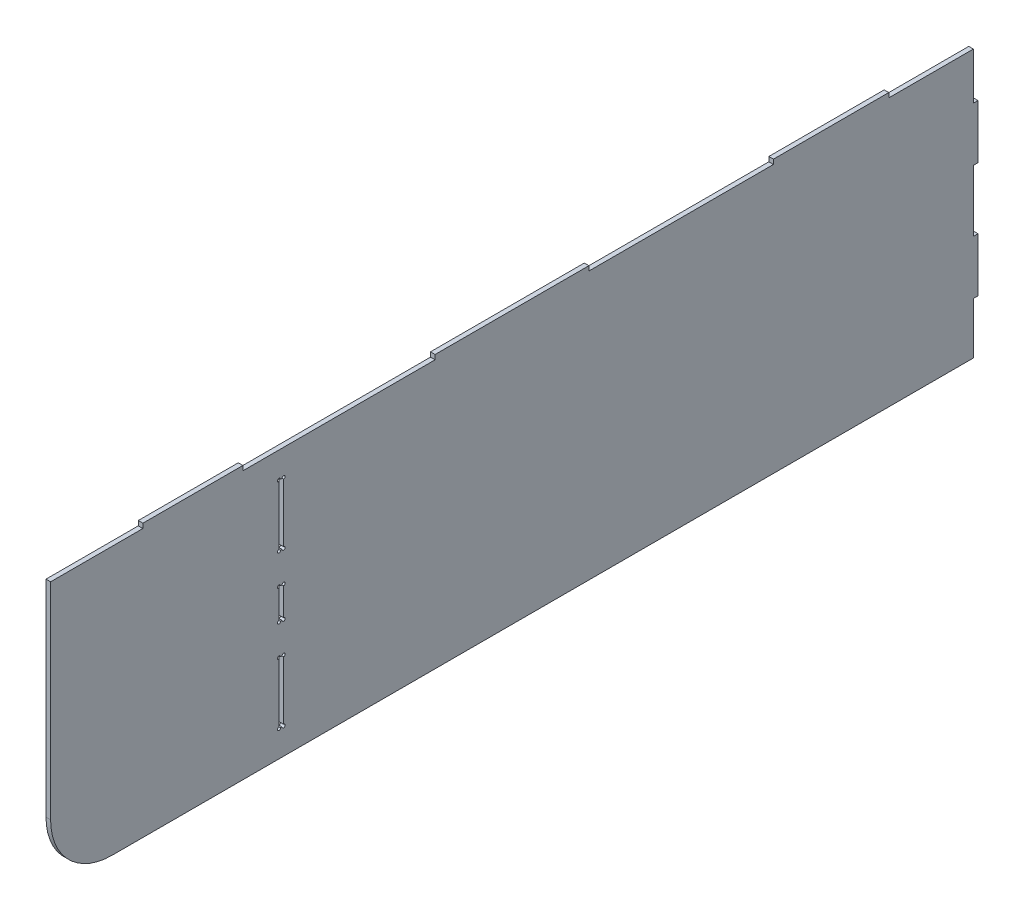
ISO-10303-21;
HEADER;
FILE_DESCRIPTION(('STEP AP214'),'2;1');
FILE_NAME('part.step','',(''),(''),'','','');
FILE_SCHEMA(('AUTOMOTIVE_DESIGN { 1 0 10303 214 1 1 1 1 }'));
ENDSEC;
DATA;
#1=APPLICATION_CONTEXT('core data for automotive mechanical design processes');
#2=APPLICATION_PROTOCOL_DEFINITION('international standard','automotive_design',2000,#1);
#3=PRODUCT_CONTEXT('',#1,'mechanical');
#4=PRODUCT('Part','Part','',(#3));
#5=PRODUCT_RELATED_PRODUCT_CATEGORY('part','',(#4));
#6=PRODUCT_DEFINITION_FORMATION('','',#4);
#7=PRODUCT_DEFINITION_CONTEXT('part definition',#1,'design');
#8=PRODUCT_DEFINITION('design','',#6,#7);
#9=PRODUCT_DEFINITION_SHAPE('','',#8);
#10=(LENGTH_UNIT() NAMED_UNIT(*) SI_UNIT(.MILLI.,.METRE.));
#11=(NAMED_UNIT(*) PLANE_ANGLE_UNIT() SI_UNIT($,.RADIAN.));
#12=(NAMED_UNIT(*) SI_UNIT($,.STERADIAN.) SOLID_ANGLE_UNIT());
#13=UNCERTAINTY_MEASURE_WITH_UNIT(LENGTH_MEASURE(1.E-05),#10,'distance_accuracy_value','');
#14=(GEOMETRIC_REPRESENTATION_CONTEXT(3) GLOBAL_UNCERTAINTY_ASSIGNED_CONTEXT((#13)) GLOBAL_UNIT_ASSIGNED_CONTEXT((#10,
#11,#12)) REPRESENTATION_CONTEXT('',''));
#15=CARTESIAN_POINT('',(0.,0.,0.));
#16=DIRECTION('',(0.,0.,1.));
#17=DIRECTION('',(1.,0.,0.));
#18=AXIS2_PLACEMENT_3D('',#15,#16,#17);
#19=CARTESIAN_POINT('',(-604.,168.,-466.));
#20=DIRECTION('',(0.,-1.,0.));
#21=DIRECTION('',(0.,0.,-1.));
#22=AXIS2_PLACEMENT_3D('',#19,#20,#21);
#23=PLANE('',#22);
#24=DIRECTION('',(0.,0.,1.));
#25=VECTOR('',#24,1.);
#26=CARTESIAN_POINT('',(-604.,168.,-466.));
#27=LINE('',#26,#25);
#28=CARTESIAN_POINT('',(-604.,168.,700.));
#29=VERTEX_POINT('',#28);
#30=CARTESIAN_POINT('',(-604.,168.,950.));
#31=VERTEX_POINT('',#30);
#32=EDGE_CURVE('E691',#29,#31,#27,.T.);
#33=ORIENTED_EDGE('',*,*,#32,.T.);
#34=DIRECTION('',(1.,0.,0.));
#35=VECTOR('',#34,1.);
#36=CARTESIAN_POINT('',(-604.,168.,950.));
#37=LINE('',#36,#35);
#38=CARTESIAN_POINT('',(-598.,168.,950.));
#39=VERTEX_POINT('',#38);
#40=EDGE_CURVE('E883',#31,#39,#37,.T.);
#41=ORIENTED_EDGE('',*,*,#40,.T.);
#42=DIRECTION('',(0.,0.,1.));
#43=VECTOR('',#42,1.);
#44=CARTESIAN_POINT('',(-598.,168.,-466.));
#45=LINE('',#44,#43);
#46=CARTESIAN_POINT('',(-598.,168.,700.));
#47=VERTEX_POINT('',#46);
#48=EDGE_CURVE('E685',#47,#39,#45,.T.);
#49=ORIENTED_EDGE('',*,*,#48,.F.);
#50=DIRECTION('',(-1.,0.,0.));
#51=VECTOR('',#50,1.);
#52=CARTESIAN_POINT('',(-604.,168.,700.));
#53=LINE('',#52,#51);
#54=EDGE_CURVE('E871',#47,#29,#53,.T.);
#55=ORIENTED_EDGE('',*,*,#54,.T.);
#56=EDGE_LOOP('',(#33,#41,#49,#55));
#57=FACE_BOUND('',#56,.T.);
#58=ADVANCED_FACE('F129',(#57),#23,.F.);
#59=CARTESIAN_POINT('',(-604.,168.,0.));
#60=VERTEX_POINT('',#59);
#61=CARTESIAN_POINT('',(-604.,168.,110.));
#62=VERTEX_POINT('',#61);
#63=EDGE_CURVE('E686',#60,#62,#27,.T.);
#64=ORIENTED_EDGE('',*,*,#63,.T.);
#65=DIRECTION('',(1.,0.,0.));
#66=VECTOR('',#65,1.);
#67=CARTESIAN_POINT('',(-604.,168.,110.));
#68=LINE('',#67,#66);
#69=CARTESIAN_POINT('',(-598.,168.,110.));
#70=VERTEX_POINT('',#69);
#71=EDGE_CURVE('E527',#62,#70,#68,.T.);
#72=ORIENTED_EDGE('',*,*,#71,.T.);
#73=CARTESIAN_POINT('',(-598.,168.,0.));
#74=VERTEX_POINT('',#73);
#75=EDGE_CURVE('E678',#74,#70,#45,.T.);
#76=ORIENTED_EDGE('',*,*,#75,.F.);
#77=DIRECTION('',(1.,0.,0.));
#78=VECTOR('',#77,1.);
#79=CARTESIAN_POINT('',(0.,168.,0.));
#80=LINE('',#79,#78);
#81=EDGE_CURVE('E792',#60,#74,#80,.T.);
#82=ORIENTED_EDGE('',*,*,#81,.F.);
#83=EDGE_LOOP('',(#64,#72,#76,#82));
#84=FACE_BOUND('',#83,.T.);
#85=ADVANCED_FACE('F979',(#84),#23,.F.);
#86=CARTESIAN_POINT('',(-598.,168.,260.));
#87=VERTEX_POINT('',#86);
#88=CARTESIAN_POINT('',(-598.,168.,500.));
#89=VERTEX_POINT('',#88);
#90=EDGE_CURVE('E683',#87,#89,#45,.T.);
#91=ORIENTED_EDGE('',*,*,#90,.F.);
#92=DIRECTION('',(-1.,0.,0.));
#93=VECTOR('',#92,1.);
#94=CARTESIAN_POINT('',(-604.,168.,260.));
#95=LINE('',#94,#93);
#96=CARTESIAN_POINT('',(-604.,168.,260.));
#97=VERTEX_POINT('',#96);
#98=EDGE_CURVE('E516',#87,#97,#95,.T.);
#99=ORIENTED_EDGE('',*,*,#98,.T.);
#100=CARTESIAN_POINT('',(-604.,168.,500.));
#101=VERTEX_POINT('',#100);
#102=EDGE_CURVE('E690',#97,#101,#27,.T.);
#103=ORIENTED_EDGE('',*,*,#102,.T.);
#104=DIRECTION('',(1.,0.,0.));
#105=VECTOR('',#104,1.);
#106=CARTESIAN_POINT('',(-604.,168.,500.));
#107=LINE('',#106,#105);
#108=EDGE_CURVE('E875',#101,#89,#107,.T.);
#109=ORIENTED_EDGE('',*,*,#108,.T.);
#110=EDGE_LOOP('',(#91,#99,#103,#109));
#111=FACE_BOUND('',#110,.T.);
#112=ADVANCED_FACE('F986',(#111),#23,.F.);
#113=CARTESIAN_POINT('',(-604.,0.,1200.));
#114=DIRECTION('',(1.,0.,0.));
#115=DIRECTION('',(0.,0.,-1.));
#116=AXIS2_PLACEMENT_3D('',#113,#114,#115);
#117=PLANE('',#116);
#118=DIRECTION('',(0.,1.,0.));
#119=VECTOR('',#118,1.);
#120=CARTESIAN_POINT('',(-604.,0.,897.));
#121=LINE('',#120,#119);
#122=CARTESIAN_POINT('',(-604.,-23.9999999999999,897.));
#123=VERTEX_POINT('',#122);
#124=CARTESIAN_POINT('',(-604.,12.0000000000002,897.));
#125=VERTEX_POINT('',#124);
#126=EDGE_CURVE('E459',#123,#125,#121,.T.);
#127=ORIENTED_EDGE('',*,*,#126,.T.);
#128=CARTESIAN_POINT('',(-604.,14.0000000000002,897.));
#129=DIRECTION('',(1.,0.,0.));
#130=DIRECTION('',(0.,0.,-1.));
#131=AXIS2_PLACEMENT_3D('',#128,#129,#130);
#132=CIRCLE('',#131,2.);
#133=CARTESIAN_POINT('',(-604.,14.0000000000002,899.));
#134=VERTEX_POINT('',#133);
#135=EDGE_CURVE('E449',#125,#134,#132,.T.);
#136=ORIENTED_EDGE('',*,*,#135,.T.);
#137=DIRECTION('',(0.,0.,1.));
#138=VECTOR('',#137,1.);
#139=CARTESIAN_POINT('',(-604.,14.0000000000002,1200.));
#140=LINE('',#139,#138);
#141=CARTESIAN_POINT('',(-604.,14.0000000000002,900.999999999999));
#142=VERTEX_POINT('',#141);
#143=EDGE_CURVE('E437',#134,#142,#140,.T.);
#144=ORIENTED_EDGE('',*,*,#143,.T.);
#145=CARTESIAN_POINT('',(-604.,14.0000000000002,902.999999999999));
#146=DIRECTION('',(1.,0.,0.));
#147=DIRECTION('',(0.,0.,-1.));
#148=AXIS2_PLACEMENT_3D('',#145,#146,#147);
#149=CIRCLE('',#148,2.);
#150=CARTESIAN_POINT('',(-604.,12.0000000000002,902.999999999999));
#151=VERTEX_POINT('',#150);
#152=EDGE_CURVE('E443',#142,#151,#149,.T.);
#153=ORIENTED_EDGE('',*,*,#152,.T.);
#154=DIRECTION('',(0.,-1.,0.));
#155=VECTOR('',#154,1.);
#156=CARTESIAN_POINT('',(-604.,0.,902.999999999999));
#157=LINE('',#156,#155);
#158=CARTESIAN_POINT('',(-604.,-23.9999999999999,902.999999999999));
#159=VERTEX_POINT('',#158);
#160=EDGE_CURVE('E933',#151,#159,#157,.T.);
#161=ORIENTED_EDGE('',*,*,#160,.T.);
#162=CARTESIAN_POINT('',(-604.,-25.9999999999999,902.999999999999));
#163=DIRECTION('',(1.,0.,0.));
#164=DIRECTION('',(0.,0.,-1.));
#165=AXIS2_PLACEMENT_3D('',#162,#163,#164);
#166=CIRCLE('',#165,2.);
#167=CARTESIAN_POINT('',(-604.,-25.9999999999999,900.999999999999));
#168=VERTEX_POINT('',#167);
#169=EDGE_CURVE('E937',#159,#168,#166,.T.);
#170=ORIENTED_EDGE('',*,*,#169,.T.);
#171=DIRECTION('',(0.,0.,-1.));
#172=VECTOR('',#171,1.);
#173=CARTESIAN_POINT('',(-604.,-25.9999999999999,1200.));
#174=LINE('',#173,#172);
#175=CARTESIAN_POINT('',(-604.,-25.9999999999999,899.));
#176=VERTEX_POINT('',#175);
#177=EDGE_CURVE('E941',#168,#176,#174,.T.);
#178=ORIENTED_EDGE('',*,*,#177,.T.);
#179=CARTESIAN_POINT('',(-604.,-25.9999999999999,897.));
#180=DIRECTION('',(1.,0.,0.));
#181=DIRECTION('',(0.,0.,-1.));
#182=AXIS2_PLACEMENT_3D('',#179,#180,#181);
#183=CIRCLE('',#182,2.);
#184=EDGE_CURVE('E468',#176,#123,#183,.T.);
#185=ORIENTED_EDGE('',*,*,#184,.T.);
#186=EDGE_LOOP('',(#127,#136,#144,#153,#161,#170,#178,#185));
#187=FACE_BOUND('',#186,.T.);
#188=DIRECTION('',(0.,-1.,0.));
#189=VECTOR('',#188,1.);
#190=CARTESIAN_POINT('',(-604.,162.,950.));
#191=LINE('',#190,#189);
#192=CARTESIAN_POINT('',(-604.,174.,950.));
#193=VERTEX_POINT('',#192);
#194=EDGE_CURVE('E484',#193,#31,#191,.T.);
#195=ORIENTED_EDGE('',*,*,#194,.T.);
#196=ORIENTED_EDGE('',*,*,#32,.F.);
#197=DIRECTION('',(0.,1.,0.));
#198=VECTOR('',#197,1.);
#199=CARTESIAN_POINT('',(-604.,162.,700.));
#200=LINE('',#199,#198);
#201=CARTESIAN_POINT('',(-604.,174.,700.));
#202=VERTEX_POINT('',#201);
#203=EDGE_CURVE('E531',#29,#202,#200,.T.);
#204=ORIENTED_EDGE('',*,*,#203,.T.);
#205=DIRECTION('',(0.,0.,-1.));
#206=VECTOR('',#205,1.);
#207=CARTESIAN_POINT('',(-604.,174.,500.));
#208=LINE('',#207,#206);
#209=CARTESIAN_POINT('',(-604.,174.,500.));
#210=VERTEX_POINT('',#209);
#211=EDGE_CURVE('E537',#202,#210,#208,.T.);
#212=ORIENTED_EDGE('',*,*,#211,.T.);
#213=DIRECTION('',(0.,-1.,0.));
#214=VECTOR('',#213,1.);
#215=CARTESIAN_POINT('',(-604.,162.,500.));
#216=LINE('',#215,#214);
#217=EDGE_CURVE('E532',#210,#101,#216,.T.);
#218=ORIENTED_EDGE('',*,*,#217,.T.);
#219=ORIENTED_EDGE('',*,*,#102,.F.);
#220=DIRECTION('',(0.,1.,0.));
#221=VECTOR('',#220,1.);
#222=CARTESIAN_POINT('',(-604.,162.,260.));
#223=LINE('',#222,#221);
#224=CARTESIAN_POINT('',(-604.,174.,260.));
#225=VERTEX_POINT('',#224);
#226=EDGE_CURVE('E513',#97,#225,#223,.T.);
#227=ORIENTED_EDGE('',*,*,#226,.T.);
#228=DIRECTION('',(0.,0.,-1.));
#229=VECTOR('',#228,1.);
#230=CARTESIAN_POINT('',(-604.,174.,110.));
#231=LINE('',#230,#229);
#232=CARTESIAN_POINT('',(-604.,174.,110.));
#233=VERTEX_POINT('',#232);
#234=EDGE_CURVE('E517',#225,#233,#231,.T.);
#235=ORIENTED_EDGE('',*,*,#234,.T.);
#236=DIRECTION('',(0.,-1.,0.));
#237=VECTOR('',#236,1.);
#238=CARTESIAN_POINT('',(-604.,162.,110.));
#239=LINE('',#238,#237);
#240=EDGE_CURVE('E512',#233,#62,#239,.T.);
#241=ORIENTED_EDGE('',*,*,#240,.T.);
#242=ORIENTED_EDGE('',*,*,#63,.F.);
#243=DIRECTION('',(0.,-1.,0.));
#244=VECTOR('',#243,1.);
#245=CARTESIAN_POINT('',(-604.,0.,0.));
#246=LINE('',#245,#244);
#247=CARTESIAN_POINT('',(-604.,107.,0.));
#248=VERTEX_POINT('',#247);
#249=EDGE_CURVE('E782',#60,#248,#246,.T.);
#250=ORIENTED_EDGE('',*,*,#249,.T.);
#251=DIRECTION('',(0.,0.,1.));
#252=VECTOR('',#251,1.);
#253=CARTESIAN_POINT('',(-604.,107.,0.));
#254=LINE('',#253,#252);
#255=CARTESIAN_POINT('',(-604.,107.,-6.));
#256=VERTEX_POINT('',#255);
#257=EDGE_CURVE('E704',#256,#248,#254,.T.);
#258=ORIENTED_EDGE('',*,*,#257,.F.);
#259=DIRECTION('',(0.,-1.,0.));
#260=VECTOR('',#259,1.);
#261=CARTESIAN_POINT('',(-604.,0.,-5.99999999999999));
#262=LINE('',#261,#260);
#263=CARTESIAN_POINT('',(-604.,37.,-5.99999999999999));
#264=VERTEX_POINT('',#263);
#265=EDGE_CURVE('E698',#256,#264,#262,.T.);
#266=ORIENTED_EDGE('',*,*,#265,.T.);
#267=DIRECTION('',(0.,0.,-1.));
#268=VECTOR('',#267,1.);
#269=CARTESIAN_POINT('',(-604.,37.,0.));
#270=LINE('',#269,#268);
#271=CARTESIAN_POINT('',(-604.,37.,0.));
#272=VERTEX_POINT('',#271);
#273=EDGE_CURVE('E692',#272,#264,#270,.T.);
#274=ORIENTED_EDGE('',*,*,#273,.F.);
#275=DIRECTION('',(0.,-1.,0.));
#276=VECTOR('',#275,1.);
#277=CARTESIAN_POINT('',(-604.,0.,0.));
#278=LINE('',#277,#276);
#279=CARTESIAN_POINT('',(-604.,-43.,0.));
#280=VERTEX_POINT('',#279);
#281=EDGE_CURVE('E702',#272,#280,#278,.T.);
#282=ORIENTED_EDGE('',*,*,#281,.T.);
#283=DIRECTION('',(0.,0.,-1.));
#284=VECTOR('',#283,1.);
#285=CARTESIAN_POINT('',(-604.,-43.,0.));
#286=LINE('',#285,#284);
#287=CARTESIAN_POINT('',(-604.,-43.,-6.));
#288=VERTEX_POINT('',#287);
#289=EDGE_CURVE('E727',#280,#288,#286,.T.);
#290=ORIENTED_EDGE('',*,*,#289,.T.);
#291=DIRECTION('',(0.,-1.,0.));
#292=VECTOR('',#291,1.);
#293=CARTESIAN_POINT('',(-604.,0.,-6.00000000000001));
#294=LINE('',#293,#292);
#295=CARTESIAN_POINT('',(-604.,-113.,-5.99999999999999));
#296=VERTEX_POINT('',#295);
#297=EDGE_CURVE('E717',#288,#296,#294,.T.);
#298=ORIENTED_EDGE('',*,*,#297,.T.);
#299=DIRECTION('',(0.,0.,-1.));
#300=VECTOR('',#299,1.);
#301=CARTESIAN_POINT('',(-604.,-113.,0.));
#302=LINE('',#301,#300);
#303=CARTESIAN_POINT('',(-604.,-113.,0.));
#304=VERTEX_POINT('',#303);
#305=EDGE_CURVE('E718',#304,#296,#302,.T.);
#306=ORIENTED_EDGE('',*,*,#305,.F.);
#307=CARTESIAN_POINT('',(-604.,-180.,0.));
#308=VERTEX_POINT('',#307);
#309=EDGE_CURVE('E713',#304,#308,#278,.T.);
#310=ORIENTED_EDGE('',*,*,#309,.T.);
#311=DIRECTION('',(0.,0.,1.));
#312=VECTOR('',#311,1.);
#313=CARTESIAN_POINT('',(-604.,-180.,0.));
#314=LINE('',#313,#312);
#315=CARTESIAN_POINT('',(-604.,-180.,1120.));
#316=VERTEX_POINT('',#315);
#317=EDGE_CURVE('E703',#308,#316,#314,.T.);
#318=ORIENTED_EDGE('',*,*,#317,.T.);
#319=CARTESIAN_POINT('',(-604.,-99.9999999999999,1120.));
#320=DIRECTION('',(1.,0.,0.));
#321=DIRECTION('',(0.,0.,-1.));
#322=AXIS2_PLACEMENT_3D('',#319,#320,#321);
#323=CIRCLE('',#322,80.);
#324=CARTESIAN_POINT('',(-604.,-99.9999999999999,1200.));
#325=VERTEX_POINT('',#324);
#326=EDGE_CURVE('E862',#316,#325,#323,.F.);
#327=ORIENTED_EDGE('',*,*,#326,.T.);
#328=DIRECTION('',(0.,-1.,0.));
#329=VECTOR('',#328,1.);
#330=CARTESIAN_POINT('',(-604.,0.,1200.));
#331=LINE('',#330,#329);
#332=CARTESIAN_POINT('',(-604.,168.,1200.));
#333=VERTEX_POINT('',#332);
#334=EDGE_CURVE('E783',#333,#325,#331,.T.);
#335=ORIENTED_EDGE('',*,*,#334,.F.);
#336=CARTESIAN_POINT('',(-604.,168.,1080.));
#337=VERTEX_POINT('',#336);
#338=EDGE_CURVE('E677',#337,#333,#27,.T.);
#339=ORIENTED_EDGE('',*,*,#338,.F.);
#340=DIRECTION('',(0.,1.,0.));
#341=VECTOR('',#340,1.);
#342=CARTESIAN_POINT('',(-604.,162.,1080.));
#343=LINE('',#342,#341);
#344=CARTESIAN_POINT('',(-604.,174.,1080.));
#345=VERTEX_POINT('',#344);
#346=EDGE_CURVE('E485',#337,#345,#343,.T.);
#347=ORIENTED_EDGE('',*,*,#346,.T.);
#348=DIRECTION('',(0.,0.,-1.));
#349=VECTOR('',#348,1.);
#350=CARTESIAN_POINT('',(-604.,174.,950.));
#351=LINE('',#350,#349);
#352=EDGE_CURVE('E489',#345,#193,#351,.T.);
#353=ORIENTED_EDGE('',*,*,#352,.T.);
#354=EDGE_LOOP('',(#195,#196,#204,#212,#218,#219,#227,#235,#241,#242,#250,#258,#266,#274,#282,
#290,#298,#306,#310,#318,#327,#335,#339,#347,#353));
#355=FACE_BOUND('',#354,.T.);
#356=DIRECTION('',(0.,-1.,0.));
#357=VECTOR('',#356,1.);
#358=CARTESIAN_POINT('',(-604.,-65.9999999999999,903.));
#359=LINE('',#358,#357);
#360=CARTESIAN_POINT('',(-604.,-67.9999999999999,903.));
#361=VERTEX_POINT('',#360);
#362=CARTESIAN_POINT('',(-604.,-144.,903.));
#363=VERTEX_POINT('',#362);
#364=EDGE_CURVE('E629',#361,#363,#359,.T.);
#365=ORIENTED_EDGE('',*,*,#364,.T.);
#366=CARTESIAN_POINT('',(-604.,-146.,903.));
#367=DIRECTION('',(-1.,0.,0.));
#368=DIRECTION('',(0.,0.,1.));
#369=AXIS2_PLACEMENT_3D('',#366,#367,#368);
#370=CIRCLE('',#369,2.);
#371=CARTESIAN_POINT('',(-604.,-146.,901.));
#372=VERTEX_POINT('',#371);
#373=EDGE_CURVE('E662',#372,#363,#370,.T.);
#374=ORIENTED_EDGE('',*,*,#373,.F.);
#375=DIRECTION('',(0.,0.,1.));
#376=VECTOR('',#375,1.);
#377=CARTESIAN_POINT('',(-604.,-146.,897.));
#378=LINE('',#377,#376);
#379=CARTESIAN_POINT('',(-604.,-146.,899.));
#380=VERTEX_POINT('',#379);
#381=EDGE_CURVE('E624',#380,#372,#378,.T.);
#382=ORIENTED_EDGE('',*,*,#381,.F.);
#383=CARTESIAN_POINT('',(-604.,-146.,897.));
#384=DIRECTION('',(-1.,0.,0.));
#385=DIRECTION('',(0.,0.,1.));
#386=AXIS2_PLACEMENT_3D('',#383,#384,#385);
#387=CIRCLE('',#386,2.);
#388=CARTESIAN_POINT('',(-604.,-144.,897.));
#389=VERTEX_POINT('',#388);
#390=EDGE_CURVE('E652',#389,#380,#387,.T.);
#391=ORIENTED_EDGE('',*,*,#390,.F.);
#392=DIRECTION('',(0.,-1.,0.));
#393=VECTOR('',#392,1.);
#394=CARTESIAN_POINT('',(-604.,-65.9999999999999,897.));
#395=LINE('',#394,#393);
#396=CARTESIAN_POINT('',(-604.,-67.9999999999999,897.));
#397=VERTEX_POINT('',#396);
#398=EDGE_CURVE('E620',#397,#389,#395,.T.);
#399=ORIENTED_EDGE('',*,*,#398,.F.);
#400=CARTESIAN_POINT('',(-604.,-65.9999999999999,897.));
#401=DIRECTION('',(-1.,0.,0.));
#402=DIRECTION('',(0.,0.,1.));
#403=AXIS2_PLACEMENT_3D('',#400,#401,#402);
#404=CIRCLE('',#403,2.);
#405=CARTESIAN_POINT('',(-604.,-65.9999999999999,899.));
#406=VERTEX_POINT('',#405);
#407=EDGE_CURVE('E625',#406,#397,#404,.T.);
#408=ORIENTED_EDGE('',*,*,#407,.F.);
#409=DIRECTION('',(0.,0.,1.));
#410=VECTOR('',#409,1.);
#411=CARTESIAN_POINT('',(-604.,-65.9999999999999,897.));
#412=LINE('',#411,#410);
#413=CARTESIAN_POINT('',(-604.,-65.9999999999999,901.));
#414=VERTEX_POINT('',#413);
#415=EDGE_CURVE('E566',#406,#414,#412,.T.);
#416=ORIENTED_EDGE('',*,*,#415,.T.);
#417=CARTESIAN_POINT('',(-604.,-65.9999999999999,903.));
#418=DIRECTION('',(-1.,0.,0.));
#419=DIRECTION('',(0.,0.,1.));
#420=AXIS2_PLACEMENT_3D('',#417,#418,#419);
#421=CIRCLE('',#420,2.);
#422=EDGE_CURVE('E643',#361,#414,#421,.T.);
#423=ORIENTED_EDGE('',*,*,#422,.F.);
#424=EDGE_LOOP('',(#365,#374,#382,#391,#399,#408,#416,#423));
#425=FACE_BOUND('',#424,.T.);
#426=DIRECTION('',(0.,0.,1.));
#427=VECTOR('',#426,1.);
#428=CARTESIAN_POINT('',(-604.,134.,0.));
#429=LINE('',#428,#427);
#430=CARTESIAN_POINT('',(-604.,134.,899.));
#431=VERTEX_POINT('',#430);
#432=CARTESIAN_POINT('',(-604.,134.,901.));
#433=VERTEX_POINT('',#432);
#434=EDGE_CURVE('E561',#431,#433,#429,.T.);
#435=ORIENTED_EDGE('',*,*,#434,.T.);
#436=CARTESIAN_POINT('',(-604.,134.,903.));
#437=DIRECTION('',(-1.,0.,0.));
#438=DIRECTION('',(0.,0.,1.));
#439=AXIS2_PLACEMENT_3D('',#436,#437,#438);
#440=CIRCLE('',#439,2.);
#441=CARTESIAN_POINT('',(-604.,132.,903.));
#442=VERTEX_POINT('',#441);
#443=EDGE_CURVE('E590',#442,#433,#440,.T.);
#444=ORIENTED_EDGE('',*,*,#443,.F.);
#445=DIRECTION('',(0.,-1.,0.));
#446=VECTOR('',#445,1.);
#447=CARTESIAN_POINT('',(-604.,0.,903.));
#448=LINE('',#447,#446);
#449=CARTESIAN_POINT('',(-604.,56.0000000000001,903.));
#450=VERTEX_POINT('',#449);
#451=EDGE_CURVE('E586',#442,#450,#448,.T.);
#452=ORIENTED_EDGE('',*,*,#451,.T.);
#453=CARTESIAN_POINT('',(-604.,54.0000000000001,903.));
#454=DIRECTION('',(-1.,0.,0.));
#455=DIRECTION('',(0.,0.,1.));
#456=AXIS2_PLACEMENT_3D('',#453,#454,#455);
#457=CIRCLE('',#456,2.);
#458=CARTESIAN_POINT('',(-604.,54.0000000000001,901.));
#459=VERTEX_POINT('',#458);
#460=EDGE_CURVE('E582',#459,#450,#457,.T.);
#461=ORIENTED_EDGE('',*,*,#460,.F.);
#462=DIRECTION('',(0.,0.,1.));
#463=VECTOR('',#462,1.);
#464=CARTESIAN_POINT('',(-604.,54.0000000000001,0.));
#465=LINE('',#464,#463);
#466=CARTESIAN_POINT('',(-604.,54.0000000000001,899.));
#467=VERTEX_POINT('',#466);
#468=EDGE_CURVE('E578',#467,#459,#465,.T.);
#469=ORIENTED_EDGE('',*,*,#468,.F.);
#470=CARTESIAN_POINT('',(-604.,54.0000000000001,897.));
#471=DIRECTION('',(-1.,0.,0.));
#472=DIRECTION('',(0.,0.,1.));
#473=AXIS2_PLACEMENT_3D('',#470,#471,#472);
#474=CIRCLE('',#473,1.99999999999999);
#475=CARTESIAN_POINT('',(-604.,56.0000000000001,897.));
#476=VERTEX_POINT('',#475);
#477=EDGE_CURVE('E574',#476,#467,#474,.T.);
#478=ORIENTED_EDGE('',*,*,#477,.F.);
#479=DIRECTION('',(0.,-1.,0.));
#480=VECTOR('',#479,1.);
#481=CARTESIAN_POINT('',(-604.,0.,897.));
#482=LINE('',#481,#480);
#483=CARTESIAN_POINT('',(-604.,132.,897.));
#484=VERTEX_POINT('',#483);
#485=EDGE_CURVE('E570',#484,#476,#482,.T.);
#486=ORIENTED_EDGE('',*,*,#485,.F.);
#487=CARTESIAN_POINT('',(-604.,134.,897.));
#488=DIRECTION('',(-1.,0.,0.));
#489=DIRECTION('',(0.,0.,1.));
#490=AXIS2_PLACEMENT_3D('',#487,#488,#489);
#491=CIRCLE('',#490,2.);
#492=EDGE_CURVE('E565',#431,#484,#491,.T.);
#493=ORIENTED_EDGE('',*,*,#492,.F.);
#494=EDGE_LOOP('',(#435,#444,#452,#461,#469,#478,#486,#493));
#495=FACE_BOUND('',#494,.T.);
#496=ADVANCED_FACE('F456',(#187,#355,#425,#495),#117,.F.);
#497=CARTESIAN_POINT('',(-598.,0.,1200.));
#498=DIRECTION('',(1.,0.,0.));
#499=DIRECTION('',(0.,0.,-1.));
#500=AXIS2_PLACEMENT_3D('',#497,#498,#499);
#501=PLANE('',#500);
#502=CARTESIAN_POINT('',(-598.,14.0000000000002,897.));
#503=DIRECTION('',(1.,0.,0.));
#504=DIRECTION('',(0.,0.,-1.));
#505=AXIS2_PLACEMENT_3D('',#502,#503,#504);
#506=CIRCLE('',#505,2.);
#507=CARTESIAN_POINT('',(-598.,12.0000000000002,897.));
#508=VERTEX_POINT('',#507);
#509=CARTESIAN_POINT('',(-598.,14.0000000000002,899.));
#510=VERTEX_POINT('',#509);
#511=EDGE_CURVE('E12',#508,#510,#506,.T.);
#512=ORIENTED_EDGE('',*,*,#511,.F.);
#513=DIRECTION('',(0.,1.,0.));
#514=VECTOR('',#513,1.);
#515=CARTESIAN_POINT('',(-598.,0.,897.));
#516=LINE('',#515,#514);
#517=CARTESIAN_POINT('',(-598.,-23.9999999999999,897.));
#518=VERTEX_POINT('',#517);
#519=EDGE_CURVE('E138',#518,#508,#516,.T.);
#520=ORIENTED_EDGE('',*,*,#519,.F.);
#521=CARTESIAN_POINT('',(-598.,-25.9999999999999,897.));
#522=DIRECTION('',(1.,0.,0.));
#523=DIRECTION('',(0.,0.,-1.));
#524=AXIS2_PLACEMENT_3D('',#521,#522,#523);
#525=CIRCLE('',#524,2.);
#526=CARTESIAN_POINT('',(-598.,-25.9999999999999,899.));
#527=VERTEX_POINT('',#526);
#528=EDGE_CURVE('E902',#527,#518,#525,.T.);
#529=ORIENTED_EDGE('',*,*,#528,.F.);
#530=DIRECTION('',(0.,0.,-1.));
#531=VECTOR('',#530,1.);
#532=CARTESIAN_POINT('',(-598.,-25.9999999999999,1200.));
#533=LINE('',#532,#531);
#534=CARTESIAN_POINT('',(-598.,-25.9999999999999,900.999999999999));
#535=VERTEX_POINT('',#534);
#536=EDGE_CURVE('E899',#535,#527,#533,.T.);
#537=ORIENTED_EDGE('',*,*,#536,.F.);
#538=CARTESIAN_POINT('',(-598.,-25.9999999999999,902.999999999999));
#539=DIRECTION('',(1.,0.,0.));
#540=DIRECTION('',(0.,0.,-1.));
#541=AXIS2_PLACEMENT_3D('',#538,#539,#540);
#542=CIRCLE('',#541,2.);
#543=CARTESIAN_POINT('',(-598.,-23.9999999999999,902.999999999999));
#544=VERTEX_POINT('',#543);
#545=EDGE_CURVE('E896',#544,#535,#542,.T.);
#546=ORIENTED_EDGE('',*,*,#545,.F.);
#547=DIRECTION('',(0.,-1.,0.));
#548=VECTOR('',#547,1.);
#549=CARTESIAN_POINT('',(-598.,0.,902.999999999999));
#550=LINE('',#549,#548);
#551=CARTESIAN_POINT('',(-598.,12.0000000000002,902.999999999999));
#552=VERTEX_POINT('',#551);
#553=EDGE_CURVE('E893',#552,#544,#550,.T.);
#554=ORIENTED_EDGE('',*,*,#553,.F.);
#555=CARTESIAN_POINT('',(-598.,14.0000000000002,902.999999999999));
#556=DIRECTION('',(1.,0.,0.));
#557=DIRECTION('',(0.,0.,-1.));
#558=AXIS2_PLACEMENT_3D('',#555,#556,#557);
#559=CIRCLE('',#558,2.);
#560=CARTESIAN_POINT('',(-598.,14.0000000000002,900.999999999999));
#561=VERTEX_POINT('',#560);
#562=EDGE_CURVE('E890',#561,#552,#559,.T.);
#563=ORIENTED_EDGE('',*,*,#562,.F.);
#564=DIRECTION('',(0.,0.,1.));
#565=VECTOR('',#564,1.);
#566=CARTESIAN_POINT('',(-598.,14.0000000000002,1200.));
#567=LINE('',#566,#565);
#568=EDGE_CURVE('E887',#510,#561,#567,.T.);
#569=ORIENTED_EDGE('',*,*,#568,.F.);
#570=EDGE_LOOP('',(#512,#520,#529,#537,#546,#554,#563,#569));
#571=FACE_BOUND('',#570,.T.);
#572=ORIENTED_EDGE('',*,*,#48,.T.);
#573=DIRECTION('',(0.,-1.,0.));
#574=VECTOR('',#573,1.);
#575=CARTESIAN_POINT('',(-598.,162.,950.));
#576=LINE('',#575,#574);
#577=CARTESIAN_POINT('',(-598.,174.,950.));
#578=VERTEX_POINT('',#577);
#579=EDGE_CURVE('E476',#578,#39,#576,.T.);
#580=ORIENTED_EDGE('',*,*,#579,.F.);
#581=DIRECTION('',(0.,0.,-1.));
#582=VECTOR('',#581,1.);
#583=CARTESIAN_POINT('',(-598.,174.,950.));
#584=LINE('',#583,#582);
#585=CARTESIAN_POINT('',(-598.,174.,1080.));
#586=VERTEX_POINT('',#585);
#587=EDGE_CURVE('E475',#586,#578,#584,.T.);
#588=ORIENTED_EDGE('',*,*,#587,.F.);
#589=DIRECTION('',(0.,1.,0.));
#590=VECTOR('',#589,1.);
#591=CARTESIAN_POINT('',(-598.,162.,1080.));
#592=LINE('',#591,#590);
#593=CARTESIAN_POINT('',(-598.,168.,1080.));
#594=VERTEX_POINT('',#593);
#595=EDGE_CURVE('E466',#594,#586,#592,.T.);
#596=ORIENTED_EDGE('',*,*,#595,.F.);
#597=CARTESIAN_POINT('',(-598.,168.,1200.));
#598=VERTEX_POINT('',#597);
#599=EDGE_CURVE('E684',#594,#598,#45,.T.);
#600=ORIENTED_EDGE('',*,*,#599,.T.);
#601=DIRECTION('',(0.,-1.,0.));
#602=VECTOR('',#601,1.);
#603=CARTESIAN_POINT('',(-598.,0.,1200.));
#604=LINE('',#603,#602);
#605=CARTESIAN_POINT('',(-598.,-99.9999999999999,1200.));
#606=VERTEX_POINT('',#605);
#607=EDGE_CURVE('E787',#598,#606,#604,.T.);
#608=ORIENTED_EDGE('',*,*,#607,.T.);
#609=CARTESIAN_POINT('',(-598.,-99.9999999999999,1120.));
#610=DIRECTION('',(1.,0.,0.));
#611=DIRECTION('',(0.,0.,-1.));
#612=AXIS2_PLACEMENT_3D('',#609,#610,#611);
#613=CIRCLE('',#612,80.);
#614=CARTESIAN_POINT('',(-598.,-180.,1120.));
#615=VERTEX_POINT('',#614);
#616=EDGE_CURVE('E868',#606,#615,#613,.T.);
#617=ORIENTED_EDGE('',*,*,#616,.T.);
#618=DIRECTION('',(0.,0.,1.));
#619=VECTOR('',#618,1.);
#620=CARTESIAN_POINT('',(-598.,-180.,0.));
#621=LINE('',#620,#619);
#622=CARTESIAN_POINT('',(-598.,-180.,0.));
#623=VERTEX_POINT('',#622);
#624=EDGE_CURVE('E756',#623,#615,#621,.T.);
#625=ORIENTED_EDGE('',*,*,#624,.F.);
#626=DIRECTION('',(0.,-1.,0.));
#627=VECTOR('',#626,1.);
#628=CARTESIAN_POINT('',(-598.,0.,0.));
#629=LINE('',#628,#627);
#630=CARTESIAN_POINT('',(-598.,-113.,0.));
#631=VERTEX_POINT('',#630);
#632=EDGE_CURVE('E722',#631,#623,#629,.T.);
#633=ORIENTED_EDGE('',*,*,#632,.F.);
#634=DIRECTION('',(0.,0.,-1.));
#635=VECTOR('',#634,1.);
#636=CARTESIAN_POINT('',(-598.,-113.,0.));
#637=LINE('',#636,#635);
#638=CARTESIAN_POINT('',(-597.999999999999,-113.,-5.99999999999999));
#639=VERTEX_POINT('',#638);
#640=EDGE_CURVE('E731',#631,#639,#637,.T.);
#641=ORIENTED_EDGE('',*,*,#640,.T.);
#642=DIRECTION('',(0.,-1.,0.));
#643=VECTOR('',#642,1.);
#644=CARTESIAN_POINT('',(-598.,0.,-6.00000000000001));
#645=LINE('',#644,#643);
#646=CARTESIAN_POINT('',(-598.,-43.,-6.));
#647=VERTEX_POINT('',#646);
#648=EDGE_CURVE('E732',#647,#639,#645,.T.);
#649=ORIENTED_EDGE('',*,*,#648,.F.);
#650=DIRECTION('',(0.,0.,-1.));
#651=VECTOR('',#650,1.);
#652=CARTESIAN_POINT('',(-598.,-43.,0.));
#653=LINE('',#652,#651);
#654=CARTESIAN_POINT('',(-598.,-43.,0.));
#655=VERTEX_POINT('',#654);
#656=EDGE_CURVE('E737',#655,#647,#653,.T.);
#657=ORIENTED_EDGE('',*,*,#656,.F.);
#658=DIRECTION('',(0.,-1.,0.));
#659=VECTOR('',#658,1.);
#660=CARTESIAN_POINT('',(-598.,0.,0.));
#661=LINE('',#660,#659);
#662=CARTESIAN_POINT('',(-598.,37.,0.));
#663=VERTEX_POINT('',#662);
#664=EDGE_CURVE('E696',#663,#655,#661,.T.);
#665=ORIENTED_EDGE('',*,*,#664,.F.);
#666=DIRECTION('',(0.,0.,-1.));
#667=VECTOR('',#666,1.);
#668=CARTESIAN_POINT('',(-598.,37.,0.));
#669=LINE('',#668,#667);
#670=CARTESIAN_POINT('',(-598.,37.,-5.99999999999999));
#671=VERTEX_POINT('',#670);
#672=EDGE_CURVE('E682',#663,#671,#669,.T.);
#673=ORIENTED_EDGE('',*,*,#672,.T.);
#674=DIRECTION('',(0.,-1.,0.));
#675=VECTOR('',#674,1.);
#676=CARTESIAN_POINT('',(-598.,0.,-5.99999999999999));
#677=LINE('',#676,#675);
#678=CARTESIAN_POINT('',(-598.,107.,-6.));
#679=VERTEX_POINT('',#678);
#680=EDGE_CURVE('E708',#679,#671,#677,.T.);
#681=ORIENTED_EDGE('',*,*,#680,.F.);
#682=DIRECTION('',(0.,0.,1.));
#683=VECTOR('',#682,1.);
#684=CARTESIAN_POINT('',(-598.,107.,0.));
#685=LINE('',#684,#683);
#686=CARTESIAN_POINT('',(-598.,107.,0.));
#687=VERTEX_POINT('',#686);
#688=EDGE_CURVE('E748',#679,#687,#685,.T.);
#689=ORIENTED_EDGE('',*,*,#688,.T.);
#690=DIRECTION('',(0.,-1.,0.));
#691=VECTOR('',#690,1.);
#692=CARTESIAN_POINT('',(-598.,0.,0.));
#693=LINE('',#692,#691);
#694=EDGE_CURVE('E788',#74,#687,#693,.T.);
#695=ORIENTED_EDGE('',*,*,#694,.F.);
#696=ORIENTED_EDGE('',*,*,#75,.T.);
#697=DIRECTION('',(0.,-1.,0.));
#698=VECTOR('',#697,1.);
#699=CARTESIAN_POINT('',(-598.,162.,110.));
#700=LINE('',#699,#698);
#701=CARTESIAN_POINT('',(-598.,174.,110.));
#702=VERTEX_POINT('',#701);
#703=EDGE_CURVE('E504',#702,#70,#700,.T.);
#704=ORIENTED_EDGE('',*,*,#703,.F.);
#705=DIRECTION('',(0.,0.,-1.));
#706=VECTOR('',#705,1.);
#707=CARTESIAN_POINT('',(-598.,174.,110.));
#708=LINE('',#707,#706);
#709=CARTESIAN_POINT('',(-598.,174.,260.));
#710=VERTEX_POINT('',#709);
#711=EDGE_CURVE('E503',#710,#702,#708,.T.);
#712=ORIENTED_EDGE('',*,*,#711,.F.);
#713=DIRECTION('',(0.,1.,0.));
#714=VECTOR('',#713,1.);
#715=CARTESIAN_POINT('',(-598.,162.,260.));
#716=LINE('',#715,#714);
#717=EDGE_CURVE('E499',#87,#710,#716,.T.);
#718=ORIENTED_EDGE('',*,*,#717,.F.);
#719=ORIENTED_EDGE('',*,*,#90,.T.);
#720=DIRECTION('',(0.,-1.,0.));
#721=VECTOR('',#720,1.);
#722=CARTESIAN_POINT('',(-598.,162.,500.));
#723=LINE('',#722,#721);
#724=CARTESIAN_POINT('',(-598.,174.,500.));
#725=VERTEX_POINT('',#724);
#726=EDGE_CURVE('E551',#725,#89,#723,.T.);
#727=ORIENTED_EDGE('',*,*,#726,.F.);
#728=DIRECTION('',(0.,0.,-1.));
#729=VECTOR('',#728,1.);
#730=CARTESIAN_POINT('',(-598.,174.,500.));
#731=LINE('',#730,#729);
#732=CARTESIAN_POINT('',(-598.,174.,700.));
#733=VERTEX_POINT('',#732);
#734=EDGE_CURVE('E536',#733,#725,#731,.T.);
#735=ORIENTED_EDGE('',*,*,#734,.F.);
#736=DIRECTION('',(0.,1.,0.));
#737=VECTOR('',#736,1.);
#738=CARTESIAN_POINT('',(-598.,162.,700.));
#739=LINE('',#738,#737);
#740=EDGE_CURVE('E547',#47,#733,#739,.T.);
#741=ORIENTED_EDGE('',*,*,#740,.F.);
#742=EDGE_LOOP('',(#572,#580,#588,#596,#600,#608,#617,#625,#633,#641,#649,#657,#665,#673,#681,
#689,#695,#696,#704,#712,#718,#719,#727,#735,#741));
#743=FACE_BOUND('',#742,.T.);
#744=CARTESIAN_POINT('',(-598.,-146.,903.));
#745=DIRECTION('',(1.,0.,0.));
#746=DIRECTION('',(0.,0.,-1.));
#747=AXIS2_PLACEMENT_3D('',#744,#745,#746);
#748=CIRCLE('',#747,2.);
#749=CARTESIAN_POINT('',(-598.,-144.,903.));
#750=VERTEX_POINT('',#749);
#751=CARTESIAN_POINT('',(-598.,-146.,901.));
#752=VERTEX_POINT('',#751);
#753=EDGE_CURVE('E824',#750,#752,#748,.T.);
#754=ORIENTED_EDGE('',*,*,#753,.F.);
#755=DIRECTION('',(0.,1.,0.));
#756=VECTOR('',#755,1.);
#757=CARTESIAN_POINT('',(-598.,0.,903.));
#758=LINE('',#757,#756);
#759=CARTESIAN_POINT('',(-598.,-67.9999999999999,903.));
#760=VERTEX_POINT('',#759);
#761=EDGE_CURVE('E827',#750,#760,#758,.T.);
#762=ORIENTED_EDGE('',*,*,#761,.T.);
#763=CARTESIAN_POINT('',(-598.,-65.9999999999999,903.));
#764=DIRECTION('',(1.,0.,0.));
#765=DIRECTION('',(0.,0.,-1.));
#766=AXIS2_PLACEMENT_3D('',#763,#764,#765);
#767=CIRCLE('',#766,2.);
#768=CARTESIAN_POINT('',(-598.,-65.9999999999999,901.));
#769=VERTEX_POINT('',#768);
#770=EDGE_CURVE('E821',#769,#760,#767,.T.);
#771=ORIENTED_EDGE('',*,*,#770,.F.);
#772=DIRECTION('',(0.,0.,-1.));
#773=VECTOR('',#772,1.);
#774=CARTESIAN_POINT('',(-598.,-65.9999999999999,1200.));
#775=LINE('',#774,#773);
#776=CARTESIAN_POINT('',(-598.,-65.9999999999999,899.));
#777=VERTEX_POINT('',#776);
#778=EDGE_CURVE('E817',#769,#777,#775,.T.);
#779=ORIENTED_EDGE('',*,*,#778,.T.);
#780=CARTESIAN_POINT('',(-598.,-65.9999999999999,897.));
#781=DIRECTION('',(1.,0.,0.));
#782=DIRECTION('',(0.,0.,-1.));
#783=AXIS2_PLACEMENT_3D('',#780,#781,#782);
#784=CIRCLE('',#783,2.);
#785=CARTESIAN_POINT('',(-598.,-67.9999999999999,897.));
#786=VERTEX_POINT('',#785);
#787=EDGE_CURVE('E811',#786,#777,#784,.T.);
#788=ORIENTED_EDGE('',*,*,#787,.F.);
#789=DIRECTION('',(0.,1.,0.));
#790=VECTOR('',#789,1.);
#791=CARTESIAN_POINT('',(-598.,0.,897.));
#792=LINE('',#791,#790);
#793=CARTESIAN_POINT('',(-598.,-144.,897.));
#794=VERTEX_POINT('',#793);
#795=EDGE_CURVE('E804',#794,#786,#792,.T.);
#796=ORIENTED_EDGE('',*,*,#795,.F.);
#797=CARTESIAN_POINT('',(-598.,-146.,897.));
#798=DIRECTION('',(1.,0.,0.));
#799=DIRECTION('',(0.,0.,-1.));
#800=AXIS2_PLACEMENT_3D('',#797,#798,#799);
#801=CIRCLE('',#800,2.);
#802=CARTESIAN_POINT('',(-598.,-146.,899.));
#803=VERTEX_POINT('',#802);
#804=EDGE_CURVE('E807',#803,#794,#801,.T.);
#805=ORIENTED_EDGE('',*,*,#804,.F.);
#806=DIRECTION('',(0.,0.,-1.));
#807=VECTOR('',#806,1.);
#808=CARTESIAN_POINT('',(-598.,-146.,1200.));
#809=LINE('',#808,#807);
#810=EDGE_CURVE('E814',#752,#803,#809,.T.);
#811=ORIENTED_EDGE('',*,*,#810,.F.);
#812=EDGE_LOOP('',(#754,#762,#771,#779,#788,#796,#805,#811));
#813=FACE_BOUND('',#812,.T.);
#814=CARTESIAN_POINT('',(-598.,134.,903.));
#815=DIRECTION('',(1.,0.,0.));
#816=DIRECTION('',(0.,0.,-1.));
#817=AXIS2_PLACEMENT_3D('',#814,#815,#816);
#818=CIRCLE('',#817,2.);
#819=CARTESIAN_POINT('',(-598.,134.,901.));
#820=VERTEX_POINT('',#819);
#821=CARTESIAN_POINT('',(-598.,132.,903.));
#822=VERTEX_POINT('',#821);
#823=EDGE_CURVE('E851',#820,#822,#818,.T.);
#824=ORIENTED_EDGE('',*,*,#823,.F.);
#825=DIRECTION('',(0.,0.,-1.));
#826=VECTOR('',#825,1.);
#827=CARTESIAN_POINT('',(-598.,134.,1200.));
#828=LINE('',#827,#826);
#829=CARTESIAN_POINT('',(-598.,134.,899.));
#830=VERTEX_POINT('',#829);
#831=EDGE_CURVE('E854',#820,#830,#828,.T.);
#832=ORIENTED_EDGE('',*,*,#831,.T.);
#833=CARTESIAN_POINT('',(-598.,134.,897.));
#834=DIRECTION('',(1.,0.,0.));
#835=DIRECTION('',(0.,0.,-1.));
#836=AXIS2_PLACEMENT_3D('',#833,#834,#835);
#837=CIRCLE('',#836,2.);
#838=CARTESIAN_POINT('',(-598.,132.,897.));
#839=VERTEX_POINT('',#838);
#840=EDGE_CURVE('E831',#839,#830,#837,.T.);
#841=ORIENTED_EDGE('',*,*,#840,.F.);
#842=DIRECTION('',(0.,1.,0.));
#843=VECTOR('',#842,1.);
#844=CARTESIAN_POINT('',(-598.,0.,897.));
#845=LINE('',#844,#843);
#846=CARTESIAN_POINT('',(-598.,56.0000000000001,897.));
#847=VERTEX_POINT('',#846);
#848=EDGE_CURVE('E834',#847,#839,#845,.T.);
#849=ORIENTED_EDGE('',*,*,#848,.F.);
#850=CARTESIAN_POINT('',(-598.,54.0000000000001,897.));
#851=DIRECTION('',(1.,0.,0.));
#852=DIRECTION('',(0.,0.,-1.));
#853=AXIS2_PLACEMENT_3D('',#850,#851,#852);
#854=CIRCLE('',#853,1.99999999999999);
#855=CARTESIAN_POINT('',(-598.,54.0000000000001,899.));
#856=VERTEX_POINT('',#855);
#857=EDGE_CURVE('E838',#856,#847,#854,.T.);
#858=ORIENTED_EDGE('',*,*,#857,.F.);
#859=DIRECTION('',(0.,0.,-1.));
#860=VECTOR('',#859,1.);
#861=CARTESIAN_POINT('',(-598.,54.0000000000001,1200.));
#862=LINE('',#861,#860);
#863=CARTESIAN_POINT('',(-598.,54.0000000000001,901.));
#864=VERTEX_POINT('',#863);
#865=EDGE_CURVE('E841',#864,#856,#862,.T.);
#866=ORIENTED_EDGE('',*,*,#865,.F.);
#867=CARTESIAN_POINT('',(-598.,54.0000000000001,903.));
#868=DIRECTION('',(1.,0.,0.));
#869=DIRECTION('',(0.,0.,-1.));
#870=AXIS2_PLACEMENT_3D('',#867,#868,#869);
#871=CIRCLE('',#870,2.);
#872=CARTESIAN_POINT('',(-598.,56.0000000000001,903.));
#873=VERTEX_POINT('',#872);
#874=EDGE_CURVE('E844',#873,#864,#871,.T.);
#875=ORIENTED_EDGE('',*,*,#874,.F.);
#876=DIRECTION('',(0.,1.,0.));
#877=VECTOR('',#876,1.);
#878=CARTESIAN_POINT('',(-598.,0.,903.));
#879=LINE('',#878,#877);
#880=EDGE_CURVE('E847',#873,#822,#879,.T.);
#881=ORIENTED_EDGE('',*,*,#880,.T.);
#882=EDGE_LOOP('',(#824,#832,#841,#849,#858,#866,#875,#881));
#883=FACE_BOUND('',#882,.T.);
#884=ADVANCED_FACE('F915',(#571,#743,#813,#883),#501,.T.);
#885=CARTESIAN_POINT('',(0.,0.,1200.));
#886=DIRECTION('',(0.,0.,1.));
#887=DIRECTION('',(1.,0.,0.));
#888=AXIS2_PLACEMENT_3D('',#885,#886,#887);
#889=PLANE('',#888);
#890=ORIENTED_EDGE('',*,*,#334,.T.);
#891=DIRECTION('',(-1.,0.,0.));
#892=VECTOR('',#891,1.);
#893=CARTESIAN_POINT('',(0.,-99.9999999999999,1200.));
#894=LINE('',#893,#892);
#895=EDGE_CURVE('E865',#325,#606,#894,.F.);
#896=ORIENTED_EDGE('',*,*,#895,.T.);
#897=ORIENTED_EDGE('',*,*,#607,.F.);
#898=DIRECTION('',(1.,0.,0.));
#899=VECTOR('',#898,1.);
#900=CARTESIAN_POINT('',(-604.,168.,1200.));
#901=LINE('',#900,#899);
#902=EDGE_CURVE('E598',#333,#598,#901,.T.);
#903=ORIENTED_EDGE('',*,*,#902,.F.);
#904=EDGE_LOOP('',(#890,#896,#897,#903));
#905=FACE_BOUND('',#904,.T.);
#906=ADVANCED_FACE('F1026',(#905),#889,.T.);
#907=CARTESIAN_POINT('',(0.,0.,0.));
#908=DIRECTION('',(0.,0.,1.));
#909=DIRECTION('',(1.,0.,0.));
#910=AXIS2_PLACEMENT_3D('',#907,#908,#909);
#911=PLANE('',#910);
#912=ORIENTED_EDGE('',*,*,#249,.F.);
#913=ORIENTED_EDGE('',*,*,#81,.T.);
#914=ORIENTED_EDGE('',*,*,#694,.T.);
#915=DIRECTION('',(1.,0.,0.));
#916=VECTOR('',#915,1.);
#917=CARTESIAN_POINT('',(0.,107.,0.));
#918=LINE('',#917,#916);
#919=EDGE_CURVE('E795',#248,#687,#918,.T.);
#920=ORIENTED_EDGE('',*,*,#919,.F.);
#921=EDGE_LOOP('',(#912,#913,#914,#920));
#922=FACE_BOUND('',#921,.T.);
#923=ADVANCED_FACE('F1070',(#922),#911,.F.);
#924=CARTESIAN_POINT('',(641.679394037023,107.,0.));
#925=DIRECTION('',(0.,-1.,0.));
#926=DIRECTION('',(0.,0.,-1.));
#927=AXIS2_PLACEMENT_3D('',#924,#925,#926);
#928=PLANE('',#927);
#929=ORIENTED_EDGE('',*,*,#257,.T.);
#930=ORIENTED_EDGE('',*,*,#919,.T.);
#931=ORIENTED_EDGE('',*,*,#688,.F.);
#932=DIRECTION('',(-1.,0.,0.));
#933=VECTOR('',#932,1.);
#934=CARTESIAN_POINT('',(641.679394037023,107.,-6.));
#935=LINE('',#934,#933);
#936=EDGE_CURVE('E709',#679,#256,#935,.T.);
#937=ORIENTED_EDGE('',*,*,#936,.T.);
#938=EDGE_LOOP('',(#929,#930,#931,#937));
#939=FACE_BOUND('',#938,.T.);
#940=ADVANCED_FACE('F1065',(#939),#928,.F.);
#941=CARTESIAN_POINT('',(641.679394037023,0.,-6.00000000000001));
#942=DIRECTION('',(0.,0.,-1.));
#943=DIRECTION('',(0.,1.,0.));
#944=AXIS2_PLACEMENT_3D('',#941,#942,#943);
#945=PLANE('',#944);
#946=DIRECTION('',(-1.,0.,0.));
#947=VECTOR('',#946,1.);
#948=CARTESIAN_POINT('',(641.679394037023,-43.,-6.));
#949=LINE('',#948,#947);
#950=EDGE_CURVE('E741',#647,#288,#949,.T.);
#951=ORIENTED_EDGE('',*,*,#950,.F.);
#952=ORIENTED_EDGE('',*,*,#648,.T.);
#953=DIRECTION('',(-1.,0.,0.));
#954=VECTOR('',#953,1.);
#955=CARTESIAN_POINT('',(641.679394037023,-113.,-5.99999999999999));
#956=LINE('',#955,#954);
#957=EDGE_CURVE('E736',#639,#296,#956,.T.);
#958=ORIENTED_EDGE('',*,*,#957,.T.);
#959=ORIENTED_EDGE('',*,*,#297,.F.);
#960=EDGE_LOOP('',(#951,#952,#958,#959));
#961=FACE_BOUND('',#960,.T.);
#962=ADVANCED_FACE('F1046',(#961),#945,.T.);
#963=CARTESIAN_POINT('',(641.679394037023,-113.,0.));
#964=DIRECTION('',(0.,1.,0.));
#965=DIRECTION('',(0.,0.,1.));
#966=AXIS2_PLACEMENT_3D('',#963,#964,#965);
#967=PLANE('',#966);
#968=ORIENTED_EDGE('',*,*,#640,.F.);
#969=DIRECTION('',(-1.,0.,0.));
#970=VECTOR('',#969,1.);
#971=CARTESIAN_POINT('',(641.679394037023,-113.,0.));
#972=LINE('',#971,#970);
#973=EDGE_CURVE('E723',#631,#304,#972,.T.);
#974=ORIENTED_EDGE('',*,*,#973,.T.);
#975=ORIENTED_EDGE('',*,*,#305,.T.);
#976=ORIENTED_EDGE('',*,*,#957,.F.);
#977=EDGE_LOOP('',(#968,#974,#975,#976));
#978=FACE_BOUND('',#977,.T.);
#979=ADVANCED_FACE('F1041',(#978),#967,.F.);
#980=CARTESIAN_POINT('',(641.679394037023,0.,0.));
#981=DIRECTION('',(0.,0.,-1.));
#982=DIRECTION('',(-1.,0.,0.));
#983=AXIS2_PLACEMENT_3D('',#980,#981,#982);
#984=PLANE('',#983);
#985=ORIENTED_EDGE('',*,*,#973,.F.);
#986=ORIENTED_EDGE('',*,*,#632,.T.);
#987=DIRECTION('',(-1.,0.,0.));
#988=VECTOR('',#987,1.);
#989=CARTESIAN_POINT('',(641.679394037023,-180.,0.));
#990=LINE('',#989,#988);
#991=EDGE_CURVE('E760',#623,#308,#990,.T.);
#992=ORIENTED_EDGE('',*,*,#991,.T.);
#993=ORIENTED_EDGE('',*,*,#309,.F.);
#994=EDGE_LOOP('',(#985,#986,#992,#993));
#995=FACE_BOUND('',#994,.T.);
#996=ADVANCED_FACE('F1037',(#995),#984,.T.);
#997=CARTESIAN_POINT('',(641.679394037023,-180.,0.));
#998=DIRECTION('',(0.,-1.,0.));
#999=DIRECTION('',(0.,0.,-1.));
#1000=AXIS2_PLACEMENT_3D('',#997,#998,#999);
#1001=PLANE('',#1000);
#1002=ORIENTED_EDGE('',*,*,#624,.T.);
#1003=DIRECTION('',(-1.,0.,0.));
#1004=VECTOR('',#1003,1.);
#1005=CARTESIAN_POINT('',(641.679394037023,-180.,1120.));
#1006=LINE('',#1005,#1004);
#1007=EDGE_CURVE('E858',#615,#316,#1006,.T.);
#1008=ORIENTED_EDGE('',*,*,#1007,.T.);
#1009=ORIENTED_EDGE('',*,*,#317,.F.);
#1010=ORIENTED_EDGE('',*,*,#991,.F.);
#1011=EDGE_LOOP('',(#1002,#1008,#1009,#1010));
#1012=FACE_BOUND('',#1011,.T.);
#1013=ADVANCED_FACE('F1032',(#1012),#1001,.T.);
#1014=CARTESIAN_POINT('',(641.679394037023,0.,-5.99999999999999));
#1015=DIRECTION('',(0.,0.,-1.));
#1016=DIRECTION('',(0.,1.,0.));
#1017=AXIS2_PLACEMENT_3D('',#1014,#1015,#1016);
#1018=PLANE('',#1017);
#1019=ORIENTED_EDGE('',*,*,#936,.F.);
#1020=ORIENTED_EDGE('',*,*,#680,.T.);
#1021=DIRECTION('',(-1.,0.,0.));
#1022=VECTOR('',#1021,1.);
#1023=CARTESIAN_POINT('',(641.679394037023,37.,-5.99999999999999));
#1024=LINE('',#1023,#1022);
#1025=EDGE_CURVE('E752',#671,#264,#1024,.T.);
#1026=ORIENTED_EDGE('',*,*,#1025,.T.);
#1027=ORIENTED_EDGE('',*,*,#265,.F.);
#1028=EDGE_LOOP('',(#1019,#1020,#1026,#1027));
#1029=FACE_BOUND('',#1028,.T.);
#1030=ADVANCED_FACE('F1061',(#1029),#1018,.T.);
#1031=CARTESIAN_POINT('',(641.679394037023,37.,0.));
#1032=DIRECTION('',(0.,1.,0.));
#1033=DIRECTION('',(0.,0.,1.));
#1034=AXIS2_PLACEMENT_3D('',#1031,#1032,#1033);
#1035=PLANE('',#1034);
#1036=ORIENTED_EDGE('',*,*,#672,.F.);
#1037=DIRECTION('',(-1.,0.,0.));
#1038=VECTOR('',#1037,1.);
#1039=CARTESIAN_POINT('',(641.679394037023,37.,0.));
#1040=LINE('',#1039,#1038);
#1041=EDGE_CURVE('E697',#663,#272,#1040,.T.);
#1042=ORIENTED_EDGE('',*,*,#1041,.T.);
#1043=ORIENTED_EDGE('',*,*,#273,.T.);
#1044=ORIENTED_EDGE('',*,*,#1025,.F.);
#1045=EDGE_LOOP('',(#1036,#1042,#1043,#1044));
#1046=FACE_BOUND('',#1045,.T.);
#1047=ADVANCED_FACE('F1057',(#1046),#1035,.F.);
#1048=ORIENTED_EDGE('',*,*,#1041,.F.);
#1049=ORIENTED_EDGE('',*,*,#664,.T.);
#1050=DIRECTION('',(-1.,0.,0.));
#1051=VECTOR('',#1050,1.);
#1052=CARTESIAN_POINT('',(641.679394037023,-43.,0.));
#1053=LINE('',#1052,#1051);
#1054=EDGE_CURVE('E742',#655,#280,#1053,.T.);
#1055=ORIENTED_EDGE('',*,*,#1054,.T.);
#1056=ORIENTED_EDGE('',*,*,#281,.F.);
#1057=EDGE_LOOP('',(#1048,#1049,#1055,#1056));
#1058=FACE_BOUND('',#1057,.T.);
#1059=ADVANCED_FACE('F1001',(#1058),#984,.T.);
#1060=CARTESIAN_POINT('',(641.679394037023,-43.,0.));
#1061=DIRECTION('',(0.,1.,0.));
#1062=DIRECTION('',(0.,0.,1.));
#1063=AXIS2_PLACEMENT_3D('',#1060,#1061,#1062);
#1064=PLANE('',#1063);
#1065=ORIENTED_EDGE('',*,*,#1054,.F.);
#1066=ORIENTED_EDGE('',*,*,#656,.T.);
#1067=ORIENTED_EDGE('',*,*,#950,.T.);
#1068=ORIENTED_EDGE('',*,*,#289,.F.);
#1069=EDGE_LOOP('',(#1065,#1066,#1067,#1068));
#1070=FACE_BOUND('',#1069,.T.);
#1071=ADVANCED_FACE('F993',(#1070),#1064,.T.);
#1072=ORIENTED_EDGE('',*,*,#599,.F.);
#1073=DIRECTION('',(-1.,0.,0.));
#1074=VECTOR('',#1073,1.);
#1075=CARTESIAN_POINT('',(-604.,168.,1080.));
#1076=LINE('',#1075,#1074);
#1077=EDGE_CURVE('E879',#594,#337,#1076,.T.);
#1078=ORIENTED_EDGE('',*,*,#1077,.T.);
#1079=ORIENTED_EDGE('',*,*,#338,.T.);
#1080=ORIENTED_EDGE('',*,*,#902,.T.);
#1081=EDGE_LOOP('',(#1072,#1078,#1079,#1080));
#1082=FACE_BOUND('',#1081,.T.);
#1083=ADVANCED_FACE('F982',(#1082),#23,.F.);
#1084=CARTESIAN_POINT('',(-453.,-146.,903.));
#1085=DIRECTION('',(-1.,0.,0.));
#1086=DIRECTION('',(0.,0.,1.));
#1087=AXIS2_PLACEMENT_3D('',#1084,#1085,#1086);
#1088=CYLINDRICAL_SURFACE('',#1087,2.);
#1089=ORIENTED_EDGE('',*,*,#753,.T.);
#1090=DIRECTION('',(-1.,0.,0.));
#1091=VECTOR('',#1090,1.);
#1092=CARTESIAN_POINT('',(-453.,-146.,901.));
#1093=LINE('',#1092,#1091);
#1094=EDGE_CURVE('E666',#752,#372,#1093,.T.);
#1095=ORIENTED_EDGE('',*,*,#1094,.T.);
#1096=ORIENTED_EDGE('',*,*,#373,.T.);
#1097=DIRECTION('',(-1.,0.,0.));
#1098=VECTOR('',#1097,1.);
#1099=CARTESIAN_POINT('',(-453.,-144.,903.));
#1100=LINE('',#1099,#1098);
#1101=EDGE_CURVE('E560',#750,#363,#1100,.T.);
#1102=ORIENTED_EDGE('',*,*,#1101,.F.);
#1103=EDGE_LOOP('',(#1089,#1095,#1096,#1102));
#1104=FACE_BOUND('',#1103,.T.);
#1105=ADVANCED_FACE('F992',(#1104),#1088,.F.);
#1106=CARTESIAN_POINT('',(-453.,-65.9999999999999,897.));
#1107=DIRECTION('',(-1.,0.,0.));
#1108=DIRECTION('',(0.,0.,1.));
#1109=AXIS2_PLACEMENT_3D('',#1106,#1107,#1108);
#1110=CYLINDRICAL_SURFACE('',#1109,2.);
#1111=ORIENTED_EDGE('',*,*,#787,.T.);
#1112=DIRECTION('',(-1.,0.,0.));
#1113=VECTOR('',#1112,1.);
#1114=CARTESIAN_POINT('',(-453.,-65.9999999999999,899.));
#1115=LINE('',#1114,#1113);
#1116=EDGE_CURVE('E636',#777,#406,#1115,.T.);
#1117=ORIENTED_EDGE('',*,*,#1116,.T.);
#1118=ORIENTED_EDGE('',*,*,#407,.T.);
#1119=DIRECTION('',(-1.,0.,0.));
#1120=VECTOR('',#1119,1.);
#1121=CARTESIAN_POINT('',(-453.,-67.9999999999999,897.));
#1122=LINE('',#1121,#1120);
#1123=EDGE_CURVE('E639',#786,#397,#1122,.T.);
#1124=ORIENTED_EDGE('',*,*,#1123,.F.);
#1125=EDGE_LOOP('',(#1111,#1117,#1118,#1124));
#1126=FACE_BOUND('',#1125,.T.);
#1127=ADVANCED_FACE('F999',(#1126),#1110,.F.);
#1128=CARTESIAN_POINT('',(-453.,-65.9999999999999,903.));
#1129=DIRECTION('',(-1.,0.,0.));
#1130=DIRECTION('',(0.,0.,1.));
#1131=AXIS2_PLACEMENT_3D('',#1128,#1129,#1130);
#1132=CYLINDRICAL_SURFACE('',#1131,2.);
#1133=ORIENTED_EDGE('',*,*,#770,.T.);
#1134=DIRECTION('',(-1.,0.,0.));
#1135=VECTOR('',#1134,1.);
#1136=CARTESIAN_POINT('',(-453.,-67.9999999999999,903.));
#1137=LINE('',#1136,#1135);
#1138=EDGE_CURVE('E646',#760,#361,#1137,.T.);
#1139=ORIENTED_EDGE('',*,*,#1138,.T.);
#1140=ORIENTED_EDGE('',*,*,#422,.T.);
#1141=DIRECTION('',(-1.,0.,0.));
#1142=VECTOR('',#1141,1.);
#1143=CARTESIAN_POINT('',(-453.,-65.9999999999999,901.));
#1144=LINE('',#1143,#1142);
#1145=EDGE_CURVE('E649',#769,#414,#1144,.T.);
#1146=ORIENTED_EDGE('',*,*,#1145,.F.);
#1147=EDGE_LOOP('',(#1133,#1139,#1140,#1146));
#1148=FACE_BOUND('',#1147,.T.);
#1149=ADVANCED_FACE('F1169',(#1148),#1132,.F.);
#1150=CARTESIAN_POINT('',(-453.,-146.,897.));
#1151=DIRECTION('',(-1.,0.,0.));
#1152=DIRECTION('',(0.,0.,1.));
#1153=AXIS2_PLACEMENT_3D('',#1150,#1151,#1152);
#1154=CYLINDRICAL_SURFACE('',#1153,2.);
#1155=ORIENTED_EDGE('',*,*,#804,.T.);
#1156=DIRECTION('',(-1.,0.,0.));
#1157=VECTOR('',#1156,1.);
#1158=CARTESIAN_POINT('',(-453.,-144.,897.));
#1159=LINE('',#1158,#1157);
#1160=EDGE_CURVE('E656',#794,#389,#1159,.T.);
#1161=ORIENTED_EDGE('',*,*,#1160,.T.);
#1162=ORIENTED_EDGE('',*,*,#390,.T.);
#1163=DIRECTION('',(-1.,0.,0.));
#1164=VECTOR('',#1163,1.);
#1165=CARTESIAN_POINT('',(-453.,-146.,899.));
#1166=LINE('',#1165,#1164);
#1167=EDGE_CURVE('E659',#803,#380,#1166,.T.);
#1168=ORIENTED_EDGE('',*,*,#1167,.F.);
#1169=EDGE_LOOP('',(#1155,#1161,#1162,#1168));
#1170=FACE_BOUND('',#1169,.T.);
#1171=ADVANCED_FACE('F1155',(#1170),#1154,.F.);
#1172=CARTESIAN_POINT('',(-453.,-65.9999999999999,897.));
#1173=DIRECTION('',(0.,-1.,0.));
#1174=DIRECTION('',(0.,0.,-1.));
#1175=AXIS2_PLACEMENT_3D('',#1172,#1173,#1174);
#1176=PLANE('',#1175);
#1177=ORIENTED_EDGE('',*,*,#1145,.T.);
#1178=ORIENTED_EDGE('',*,*,#415,.F.);
#1179=ORIENTED_EDGE('',*,*,#1116,.F.);
#1180=ORIENTED_EDGE('',*,*,#778,.F.);
#1181=EDGE_LOOP('',(#1177,#1178,#1179,#1180));
#1182=FACE_BOUND('',#1181,.T.);
#1183=ADVANCED_FACE('F1151',(#1182),#1176,.T.);
#1184=CARTESIAN_POINT('',(-453.,-65.9999999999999,903.));
#1185=DIRECTION('',(0.,0.,-1.));
#1186=DIRECTION('',(-1.,0.,0.));
#1187=AXIS2_PLACEMENT_3D('',#1184,#1185,#1186);
#1188=PLANE('',#1187);
#1189=ORIENTED_EDGE('',*,*,#1101,.T.);
#1190=ORIENTED_EDGE('',*,*,#364,.F.);
#1191=ORIENTED_EDGE('',*,*,#1138,.F.);
#1192=ORIENTED_EDGE('',*,*,#761,.F.);
#1193=EDGE_LOOP('',(#1189,#1190,#1191,#1192));
#1194=FACE_BOUND('',#1193,.T.);
#1195=ADVANCED_FACE('F1154',(#1194),#1188,.T.);
#1196=CARTESIAN_POINT('',(-453.,-146.,897.));
#1197=DIRECTION('',(0.,-1.,0.));
#1198=DIRECTION('',(0.,0.,-1.));
#1199=AXIS2_PLACEMENT_3D('',#1196,#1197,#1198);
#1200=PLANE('',#1199);
#1201=ORIENTED_EDGE('',*,*,#810,.T.);
#1202=ORIENTED_EDGE('',*,*,#1167,.T.);
#1203=ORIENTED_EDGE('',*,*,#381,.T.);
#1204=ORIENTED_EDGE('',*,*,#1094,.F.);
#1205=EDGE_LOOP('',(#1201,#1202,#1203,#1204));
#1206=FACE_BOUND('',#1205,.T.);
#1207=ADVANCED_FACE('F1159',(#1206),#1200,.F.);
#1208=CARTESIAN_POINT('',(-453.,-65.9999999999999,897.));
#1209=DIRECTION('',(0.,0.,-1.));
#1210=DIRECTION('',(-1.,0.,0.));
#1211=AXIS2_PLACEMENT_3D('',#1208,#1209,#1210);
#1212=PLANE('',#1211);
#1213=ORIENTED_EDGE('',*,*,#795,.T.);
#1214=ORIENTED_EDGE('',*,*,#1123,.T.);
#1215=ORIENTED_EDGE('',*,*,#398,.T.);
#1216=ORIENTED_EDGE('',*,*,#1160,.F.);
#1217=EDGE_LOOP('',(#1213,#1214,#1215,#1216));
#1218=FACE_BOUND('',#1217,.T.);
#1219=ADVANCED_FACE('F1149',(#1218),#1212,.F.);
#1220=CARTESIAN_POINT('',(-453.,134.,0.));
#1221=DIRECTION('',(0.,-1.,0.));
#1222=DIRECTION('',(0.,0.,-1.));
#1223=AXIS2_PLACEMENT_3D('',#1220,#1221,#1222);
#1224=PLANE('',#1223);
#1225=DIRECTION('',(-1.,0.,0.));
#1226=VECTOR('',#1225,1.);
#1227=CARTESIAN_POINT('',(-453.,134.,901.));
#1228=LINE('',#1227,#1226);
#1229=EDGE_CURVE('E595',#820,#433,#1228,.T.);
#1230=ORIENTED_EDGE('',*,*,#1229,.T.);
#1231=ORIENTED_EDGE('',*,*,#434,.F.);
#1232=DIRECTION('',(-1.,0.,0.));
#1233=VECTOR('',#1232,1.);
#1234=CARTESIAN_POINT('',(-453.,134.,899.));
#1235=LINE('',#1234,#1233);
#1236=EDGE_CURVE('E594',#830,#431,#1235,.T.);
#1237=ORIENTED_EDGE('',*,*,#1236,.F.);
#1238=ORIENTED_EDGE('',*,*,#831,.F.);
#1239=EDGE_LOOP('',(#1230,#1231,#1237,#1238));
#1240=FACE_BOUND('',#1239,.T.);
#1241=ADVANCED_FACE('F1123',(#1240),#1224,.T.);
#1242=CARTESIAN_POINT('',(-453.,134.,903.));
#1243=DIRECTION('',(-1.,0.,0.));
#1244=DIRECTION('',(0.,0.,1.));
#1245=AXIS2_PLACEMENT_3D('',#1242,#1243,#1244);
#1246=CYLINDRICAL_SURFACE('',#1245,2.);
#1247=ORIENTED_EDGE('',*,*,#823,.T.);
#1248=DIRECTION('',(-1.,0.,0.));
#1249=VECTOR('',#1248,1.);
#1250=CARTESIAN_POINT('',(-453.,132.,903.));
#1251=LINE('',#1250,#1249);
#1252=EDGE_CURVE('E599',#822,#442,#1251,.T.);
#1253=ORIENTED_EDGE('',*,*,#1252,.T.);
#1254=ORIENTED_EDGE('',*,*,#443,.T.);
#1255=ORIENTED_EDGE('',*,*,#1229,.F.);
#1256=EDGE_LOOP('',(#1247,#1253,#1254,#1255));
#1257=FACE_BOUND('',#1256,.T.);
#1258=ADVANCED_FACE('F1119',(#1257),#1246,.F.);
#1259=CARTESIAN_POINT('',(-453.,0.,903.));
#1260=DIRECTION('',(0.,0.,-1.));
#1261=DIRECTION('',(-1.,0.,0.));
#1262=AXIS2_PLACEMENT_3D('',#1259,#1260,#1261);
#1263=PLANE('',#1262);
#1264=DIRECTION('',(-1.,0.,0.));
#1265=VECTOR('',#1264,1.);
#1266=CARTESIAN_POINT('',(-453.,56.0000000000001,903.));
#1267=LINE('',#1266,#1265);
#1268=EDGE_CURVE('E602',#873,#450,#1267,.T.);
#1269=ORIENTED_EDGE('',*,*,#1268,.T.);
#1270=ORIENTED_EDGE('',*,*,#451,.F.);
#1271=ORIENTED_EDGE('',*,*,#1252,.F.);
#1272=ORIENTED_EDGE('',*,*,#880,.F.);
#1273=EDGE_LOOP('',(#1269,#1270,#1271,#1272));
#1274=FACE_BOUND('',#1273,.T.);
#1275=ADVANCED_FACE('F1122',(#1274),#1263,.T.);
#1276=CARTESIAN_POINT('',(-453.,54.0000000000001,903.));
#1277=DIRECTION('',(-1.,0.,0.));
#1278=DIRECTION('',(0.,0.,1.));
#1279=AXIS2_PLACEMENT_3D('',#1276,#1277,#1278);
#1280=CYLINDRICAL_SURFACE('',#1279,2.);
#1281=ORIENTED_EDGE('',*,*,#874,.T.);
#1282=DIRECTION('',(-1.,0.,0.));
#1283=VECTOR('',#1282,1.);
#1284=CARTESIAN_POINT('',(-453.,54.0000000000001,901.));
#1285=LINE('',#1284,#1283);
#1286=EDGE_CURVE('E605',#864,#459,#1285,.T.);
#1287=ORIENTED_EDGE('',*,*,#1286,.T.);
#1288=ORIENTED_EDGE('',*,*,#460,.T.);
#1289=ORIENTED_EDGE('',*,*,#1268,.F.);
#1290=EDGE_LOOP('',(#1281,#1287,#1288,#1289));
#1291=FACE_BOUND('',#1290,.T.);
#1292=ADVANCED_FACE('F1127',(#1291),#1280,.F.);
#1293=CARTESIAN_POINT('',(-453.,54.0000000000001,0.));
#1294=DIRECTION('',(0.,-1.,0.));
#1295=DIRECTION('',(0.,0.,-1.));
#1296=AXIS2_PLACEMENT_3D('',#1293,#1294,#1295);
#1297=PLANE('',#1296);
#1298=ORIENTED_EDGE('',*,*,#865,.T.);
#1299=DIRECTION('',(-1.,0.,0.));
#1300=VECTOR('',#1299,1.);
#1301=CARTESIAN_POINT('',(-453.,54.0000000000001,899.));
#1302=LINE('',#1301,#1300);
#1303=EDGE_CURVE('E608',#856,#467,#1302,.T.);
#1304=ORIENTED_EDGE('',*,*,#1303,.T.);
#1305=ORIENTED_EDGE('',*,*,#468,.T.);
#1306=ORIENTED_EDGE('',*,*,#1286,.F.);
#1307=EDGE_LOOP('',(#1298,#1304,#1305,#1306));
#1308=FACE_BOUND('',#1307,.T.);
#1309=ADVANCED_FACE('F1131',(#1308),#1297,.F.);
#1310=CARTESIAN_POINT('',(-453.,54.0000000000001,897.));
#1311=DIRECTION('',(-1.,0.,0.));
#1312=DIRECTION('',(0.,0.,1.));
#1313=AXIS2_PLACEMENT_3D('',#1310,#1311,#1312);
#1314=CYLINDRICAL_SURFACE('',#1313,1.99999999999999);
#1315=ORIENTED_EDGE('',*,*,#857,.T.);
#1316=DIRECTION('',(-1.,0.,0.));
#1317=VECTOR('',#1316,1.);
#1318=CARTESIAN_POINT('',(-453.,56.0000000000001,897.));
#1319=LINE('',#1318,#1317);
#1320=EDGE_CURVE('E611',#847,#476,#1319,.T.);
#1321=ORIENTED_EDGE('',*,*,#1320,.T.);
#1322=ORIENTED_EDGE('',*,*,#477,.T.);
#1323=ORIENTED_EDGE('',*,*,#1303,.F.);
#1324=EDGE_LOOP('',(#1315,#1321,#1322,#1323));
#1325=FACE_BOUND('',#1324,.T.);
#1326=ADVANCED_FACE('F1135',(#1325),#1314,.F.);
#1327=CARTESIAN_POINT('',(-453.,0.,897.));
#1328=DIRECTION('',(0.,0.,-1.));
#1329=DIRECTION('',(-1.,0.,0.));
#1330=AXIS2_PLACEMENT_3D('',#1327,#1328,#1329);
#1331=PLANE('',#1330);
#1332=ORIENTED_EDGE('',*,*,#848,.T.);
#1333=DIRECTION('',(-1.,0.,0.));
#1334=VECTOR('',#1333,1.);
#1335=CARTESIAN_POINT('',(-453.,132.,897.));
#1336=LINE('',#1335,#1334);
#1337=EDGE_CURVE('E614',#839,#484,#1336,.T.);
#1338=ORIENTED_EDGE('',*,*,#1337,.T.);
#1339=ORIENTED_EDGE('',*,*,#485,.T.);
#1340=ORIENTED_EDGE('',*,*,#1320,.F.);
#1341=EDGE_LOOP('',(#1332,#1338,#1339,#1340));
#1342=FACE_BOUND('',#1341,.T.);
#1343=ADVANCED_FACE('F1139',(#1342),#1331,.F.);
#1344=CARTESIAN_POINT('',(-453.,134.,897.));
#1345=DIRECTION('',(-1.,0.,0.));
#1346=DIRECTION('',(0.,0.,1.));
#1347=AXIS2_PLACEMENT_3D('',#1344,#1345,#1346);
#1348=CYLINDRICAL_SURFACE('',#1347,2.);
#1349=ORIENTED_EDGE('',*,*,#840,.T.);
#1350=ORIENTED_EDGE('',*,*,#1236,.T.);
#1351=ORIENTED_EDGE('',*,*,#492,.T.);
#1352=ORIENTED_EDGE('',*,*,#1337,.F.);
#1353=EDGE_LOOP('',(#1349,#1350,#1351,#1352));
#1354=FACE_BOUND('',#1353,.T.);
#1355=ADVANCED_FACE('F1114',(#1354),#1348,.F.);
#1356=CARTESIAN_POINT('',(641.679394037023,-99.9999999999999,1120.));
#1357=DIRECTION('',(-1.,0.,0.));
#1358=DIRECTION('',(0.,0.,1.));
#1359=AXIS2_PLACEMENT_3D('',#1356,#1357,#1358);
#1360=CYLINDRICAL_SURFACE('',#1359,80.);
#1361=ORIENTED_EDGE('',*,*,#616,.F.);
#1362=ORIENTED_EDGE('',*,*,#895,.F.);
#1363=ORIENTED_EDGE('',*,*,#326,.F.);
#1364=ORIENTED_EDGE('',*,*,#1007,.F.);
#1365=EDGE_LOOP('',(#1361,#1362,#1363,#1364));
#1366=FACE_BOUND('',#1365,.T.);
#1367=ADVANCED_FACE('F131',(#1366),#1360,.T.);
#1368=CARTESIAN_POINT('',(-397.640323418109,162.,500.));
#1369=DIRECTION('',(0.,0.,-1.));
#1370=DIRECTION('',(-1.,0.,0.));
#1371=AXIS2_PLACEMENT_3D('',#1368,#1369,#1370);
#1372=PLANE('',#1371);
#1373=ORIENTED_EDGE('',*,*,#108,.F.);
#1374=ORIENTED_EDGE('',*,*,#217,.F.);
#1375=DIRECTION('',(-1.,0.,0.));
#1376=VECTOR('',#1375,1.);
#1377=CARTESIAN_POINT('',(-397.640323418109,174.,500.));
#1378=LINE('',#1377,#1376);
#1379=EDGE_CURVE('E546',#725,#210,#1378,.T.);
#1380=ORIENTED_EDGE('',*,*,#1379,.F.);
#1381=ORIENTED_EDGE('',*,*,#726,.T.);
#1382=EDGE_LOOP('',(#1373,#1374,#1380,#1381));
#1383=FACE_BOUND('',#1382,.T.);
#1384=ADVANCED_FACE('F1106',(#1383),#1372,.T.);
#1385=CARTESIAN_POINT('',(-397.640323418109,162.,700.));
#1386=DIRECTION('',(0.,0.,1.));
#1387=DIRECTION('',(1.,0.,0.));
#1388=AXIS2_PLACEMENT_3D('',#1385,#1386,#1387);
#1389=PLANE('',#1388);
#1390=ORIENTED_EDGE('',*,*,#54,.F.);
#1391=ORIENTED_EDGE('',*,*,#740,.T.);
#1392=DIRECTION('',(-1.,0.,0.));
#1393=VECTOR('',#1392,1.);
#1394=CARTESIAN_POINT('',(-397.640323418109,174.,700.));
#1395=LINE('',#1394,#1393);
#1396=EDGE_CURVE('E550',#733,#202,#1395,.T.);
#1397=ORIENTED_EDGE('',*,*,#1396,.T.);
#1398=ORIENTED_EDGE('',*,*,#203,.F.);
#1399=EDGE_LOOP('',(#1390,#1391,#1397,#1398));
#1400=FACE_BOUND('',#1399,.T.);
#1401=ADVANCED_FACE('F1100',(#1400),#1389,.T.);
#1402=CARTESIAN_POINT('',(-397.640323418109,174.,500.));
#1403=DIRECTION('',(0.,1.,0.));
#1404=DIRECTION('',(0.,0.,1.));
#1405=AXIS2_PLACEMENT_3D('',#1402,#1403,#1404);
#1406=PLANE('',#1405);
#1407=ORIENTED_EDGE('',*,*,#1396,.F.);
#1408=ORIENTED_EDGE('',*,*,#734,.T.);
#1409=ORIENTED_EDGE('',*,*,#1379,.T.);
#1410=ORIENTED_EDGE('',*,*,#211,.F.);
#1411=EDGE_LOOP('',(#1407,#1408,#1409,#1410));
#1412=FACE_BOUND('',#1411,.T.);
#1413=ADVANCED_FACE('F1103',(#1412),#1406,.T.);
#1414=CARTESIAN_POINT('',(-397.640323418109,162.,110.));
#1415=DIRECTION('',(0.,0.,-1.));
#1416=DIRECTION('',(-1.,0.,0.));
#1417=AXIS2_PLACEMENT_3D('',#1414,#1415,#1416);
#1418=PLANE('',#1417);
#1419=ORIENTED_EDGE('',*,*,#71,.F.);
#1420=ORIENTED_EDGE('',*,*,#240,.F.);
#1421=DIRECTION('',(-1.,0.,0.));
#1422=VECTOR('',#1421,1.);
#1423=CARTESIAN_POINT('',(-397.640323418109,174.,110.));
#1424=LINE('',#1423,#1422);
#1425=EDGE_CURVE('E500',#702,#233,#1424,.T.);
#1426=ORIENTED_EDGE('',*,*,#1425,.F.);
#1427=ORIENTED_EDGE('',*,*,#703,.T.);
#1428=EDGE_LOOP('',(#1419,#1420,#1426,#1427));
#1429=FACE_BOUND('',#1428,.T.);
#1430=ADVANCED_FACE('F1077',(#1429),#1418,.T.);
#1431=CARTESIAN_POINT('',(-397.640323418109,162.,260.));
#1432=DIRECTION('',(0.,0.,1.));
#1433=DIRECTION('',(1.,0.,0.));
#1434=AXIS2_PLACEMENT_3D('',#1431,#1432,#1433);
#1435=PLANE('',#1434);
#1436=ORIENTED_EDGE('',*,*,#98,.F.);
#1437=ORIENTED_EDGE('',*,*,#717,.T.);
#1438=DIRECTION('',(-1.,0.,0.));
#1439=VECTOR('',#1438,1.);
#1440=CARTESIAN_POINT('',(-397.640323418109,174.,260.));
#1441=LINE('',#1440,#1439);
#1442=EDGE_CURVE('E488',#710,#225,#1441,.T.);
#1443=ORIENTED_EDGE('',*,*,#1442,.T.);
#1444=ORIENTED_EDGE('',*,*,#226,.F.);
#1445=EDGE_LOOP('',(#1436,#1437,#1443,#1444));
#1446=FACE_BOUND('',#1445,.T.);
#1447=ADVANCED_FACE('F1083',(#1446),#1435,.T.);
#1448=CARTESIAN_POINT('',(-397.640323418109,174.,110.));
#1449=DIRECTION('',(0.,1.,0.));
#1450=DIRECTION('',(0.,0.,1.));
#1451=AXIS2_PLACEMENT_3D('',#1448,#1449,#1450);
#1452=PLANE('',#1451);
#1453=ORIENTED_EDGE('',*,*,#1442,.F.);
#1454=ORIENTED_EDGE('',*,*,#711,.T.);
#1455=ORIENTED_EDGE('',*,*,#1425,.T.);
#1456=ORIENTED_EDGE('',*,*,#234,.F.);
#1457=EDGE_LOOP('',(#1453,#1454,#1455,#1456));
#1458=FACE_BOUND('',#1457,.T.);
#1459=ADVANCED_FACE('F1081',(#1458),#1452,.T.);
#1460=CARTESIAN_POINT('',(-397.640323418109,162.,950.));
#1461=DIRECTION('',(0.,0.,-1.));
#1462=DIRECTION('',(-1.,0.,0.));
#1463=AXIS2_PLACEMENT_3D('',#1460,#1461,#1462);
#1464=PLANE('',#1463);
#1465=ORIENTED_EDGE('',*,*,#40,.F.);
#1466=ORIENTED_EDGE('',*,*,#194,.F.);
#1467=DIRECTION('',(-1.,0.,0.));
#1468=VECTOR('',#1467,1.);
#1469=CARTESIAN_POINT('',(-397.640323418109,174.,950.));
#1470=LINE('',#1469,#1468);
#1471=EDGE_CURVE('E472',#578,#193,#1470,.T.);
#1472=ORIENTED_EDGE('',*,*,#1471,.F.);
#1473=ORIENTED_EDGE('',*,*,#579,.T.);
#1474=EDGE_LOOP('',(#1465,#1466,#1472,#1473));
#1475=FACE_BOUND('',#1474,.T.);
#1476=ADVANCED_FACE('F1094',(#1475),#1464,.T.);
#1477=CARTESIAN_POINT('',(-397.640323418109,162.,1080.));
#1478=DIRECTION('',(0.,0.,1.));
#1479=DIRECTION('',(1.,0.,0.));
#1480=AXIS2_PLACEMENT_3D('',#1477,#1478,#1479);
#1481=PLANE('',#1480);
#1482=ORIENTED_EDGE('',*,*,#1077,.F.);
#1483=ORIENTED_EDGE('',*,*,#595,.T.);
#1484=DIRECTION('',(-1.,0.,0.));
#1485=VECTOR('',#1484,1.);
#1486=CARTESIAN_POINT('',(-397.640323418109,174.,1080.));
#1487=LINE('',#1486,#1485);
#1488=EDGE_CURVE('E461',#586,#345,#1487,.T.);
#1489=ORIENTED_EDGE('',*,*,#1488,.T.);
#1490=ORIENTED_EDGE('',*,*,#346,.F.);
#1491=EDGE_LOOP('',(#1482,#1483,#1489,#1490));
#1492=FACE_BOUND('',#1491,.T.);
#1493=ADVANCED_FACE('F1560',(#1492),#1481,.T.);
#1494=CARTESIAN_POINT('',(-397.640323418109,174.,950.));
#1495=DIRECTION('',(0.,1.,0.));
#1496=DIRECTION('',(0.,0.,1.));
#1497=AXIS2_PLACEMENT_3D('',#1494,#1495,#1496);
#1498=PLANE('',#1497);
#1499=ORIENTED_EDGE('',*,*,#1488,.F.);
#1500=ORIENTED_EDGE('',*,*,#587,.T.);
#1501=ORIENTED_EDGE('',*,*,#1471,.T.);
#1502=ORIENTED_EDGE('',*,*,#352,.F.);
#1503=EDGE_LOOP('',(#1499,#1500,#1501,#1502));
#1504=FACE_BOUND('',#1503,.T.);
#1505=ADVANCED_FACE('F1569',(#1504),#1498,.T.);
#1506=CARTESIAN_POINT('',(-638.5,14.0000000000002,897.));
#1507=DIRECTION('',(1.,0.,0.));
#1508=DIRECTION('',(0.,0.,-1.));
#1509=AXIS2_PLACEMENT_3D('',#1506,#1507,#1508);
#1510=CYLINDRICAL_SURFACE('',#1509,2.);
#1511=DIRECTION('',(1.,0.,0.));
#1512=VECTOR('',#1511,1.);
#1513=CARTESIAN_POINT('',(-638.5,12.0000000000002,897.));
#1514=LINE('',#1513,#1512);
#1515=EDGE_CURVE('E444',#125,#508,#1514,.T.);
#1516=ORIENTED_EDGE('',*,*,#1515,.T.);
#1517=ORIENTED_EDGE('',*,*,#511,.T.);
#1518=DIRECTION('',(1.,0.,0.));
#1519=VECTOR('',#1518,1.);
#1520=CARTESIAN_POINT('',(-638.5,14.0000000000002,899.));
#1521=LINE('',#1520,#1519);
#1522=EDGE_CURVE('E150',#134,#510,#1521,.T.);
#1523=ORIENTED_EDGE('',*,*,#1522,.F.);
#1524=ORIENTED_EDGE('',*,*,#135,.F.);
#1525=EDGE_LOOP('',(#1516,#1517,#1523,#1524));
#1526=FACE_BOUND('',#1525,.T.);
#1527=ADVANCED_FACE('F448',(#1526),#1510,.F.);
#1528=CARTESIAN_POINT('',(-638.5,12.0000000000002,897.));
#1529=DIRECTION('',(0.,0.,-1.));
#1530=DIRECTION('',(-1.,0.,0.));
#1531=AXIS2_PLACEMENT_3D('',#1528,#1529,#1530);
#1532=PLANE('',#1531);
#1533=DIRECTION('',(1.,0.,0.));
#1534=VECTOR('',#1533,1.);
#1535=CARTESIAN_POINT('',(-638.5,-23.9999999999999,897.));
#1536=LINE('',#1535,#1534);
#1537=EDGE_CURVE('E910',#123,#518,#1536,.T.);
#1538=ORIENTED_EDGE('',*,*,#1537,.T.);
#1539=ORIENTED_EDGE('',*,*,#519,.T.);
#1540=ORIENTED_EDGE('',*,*,#1515,.F.);
#1541=ORIENTED_EDGE('',*,*,#126,.F.);
#1542=EDGE_LOOP('',(#1538,#1539,#1540,#1541));
#1543=FACE_BOUND('',#1542,.T.);
#1544=ADVANCED_FACE('F908',(#1543),#1532,.F.);
#1545=CARTESIAN_POINT('',(-638.5,-25.9999999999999,897.));
#1546=DIRECTION('',(1.,0.,0.));
#1547=DIRECTION('',(0.,0.,-1.));
#1548=AXIS2_PLACEMENT_3D('',#1545,#1546,#1547);
#1549=CYLINDRICAL_SURFACE('',#1548,2.);
#1550=DIRECTION('',(1.,0.,0.));
#1551=VECTOR('',#1550,1.);
#1552=CARTESIAN_POINT('',(-638.5,-25.9999999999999,899.));
#1553=LINE('',#1552,#1551);
#1554=EDGE_CURVE('E949',#176,#527,#1553,.T.);
#1555=ORIENTED_EDGE('',*,*,#1554,.T.);
#1556=ORIENTED_EDGE('',*,*,#528,.T.);
#1557=ORIENTED_EDGE('',*,*,#1537,.F.);
#1558=ORIENTED_EDGE('',*,*,#184,.F.);
#1559=EDGE_LOOP('',(#1555,#1556,#1557,#1558));
#1560=FACE_BOUND('',#1559,.T.);
#1561=ADVANCED_FACE('F948',(#1560),#1549,.F.);
#1562=CARTESIAN_POINT('',(-638.5,-25.9999999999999,900.999999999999));
#1563=DIRECTION('',(0.,-1.,0.));
#1564=DIRECTION('',(0.,0.,-1.));
#1565=AXIS2_PLACEMENT_3D('',#1562,#1563,#1564);
#1566=PLANE('',#1565);
#1567=DIRECTION('',(1.,0.,0.));
#1568=VECTOR('',#1567,1.);
#1569=CARTESIAN_POINT('',(-638.5,-25.9999999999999,900.999999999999));
#1570=LINE('',#1569,#1568);
#1571=EDGE_CURVE('E956',#168,#535,#1570,.T.);
#1572=ORIENTED_EDGE('',*,*,#1571,.T.);
#1573=ORIENTED_EDGE('',*,*,#536,.T.);
#1574=ORIENTED_EDGE('',*,*,#1554,.F.);
#1575=ORIENTED_EDGE('',*,*,#177,.F.);
#1576=EDGE_LOOP('',(#1572,#1573,#1574,#1575));
#1577=FACE_BOUND('',#1576,.T.);
#1578=ADVANCED_FACE('F952',(#1577),#1566,.F.);
#1579=CARTESIAN_POINT('',(-638.5,-25.9999999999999,902.999999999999));
#1580=DIRECTION('',(1.,0.,0.));
#1581=DIRECTION('',(0.,0.,-1.));
#1582=AXIS2_PLACEMENT_3D('',#1579,#1580,#1581);
#1583=CYLINDRICAL_SURFACE('',#1582,2.);
#1584=DIRECTION('',(1.,0.,0.));
#1585=VECTOR('',#1584,1.);
#1586=CARTESIAN_POINT('',(-638.5,-23.9999999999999,902.999999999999));
#1587=LINE('',#1586,#1585);
#1588=EDGE_CURVE('E927',#159,#544,#1587,.T.);
#1589=ORIENTED_EDGE('',*,*,#1588,.T.);
#1590=ORIENTED_EDGE('',*,*,#545,.T.);
#1591=ORIENTED_EDGE('',*,*,#1571,.F.);
#1592=ORIENTED_EDGE('',*,*,#169,.F.);
#1593=EDGE_LOOP('',(#1589,#1590,#1591,#1592));
#1594=FACE_BOUND('',#1593,.T.);
#1595=ADVANCED_FACE('F967',(#1594),#1583,.F.);
#1596=CARTESIAN_POINT('',(-638.5,12.0000000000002,902.999999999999));
#1597=DIRECTION('',(0.,0.,1.));
#1598=DIRECTION('',(1.,0.,0.));
#1599=AXIS2_PLACEMENT_3D('',#1596,#1597,#1598);
#1600=PLANE('',#1599);
#1601=DIRECTION('',(1.,0.,0.));
#1602=VECTOR('',#1601,1.);
#1603=CARTESIAN_POINT('',(-638.5,12.0000000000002,902.999999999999));
#1604=LINE('',#1603,#1602);
#1605=EDGE_CURVE('E924',#151,#552,#1604,.T.);
#1606=ORIENTED_EDGE('',*,*,#1605,.T.);
#1607=ORIENTED_EDGE('',*,*,#553,.T.);
#1608=ORIENTED_EDGE('',*,*,#1588,.F.);
#1609=ORIENTED_EDGE('',*,*,#160,.F.);
#1610=EDGE_LOOP('',(#1606,#1607,#1608,#1609));
#1611=FACE_BOUND('',#1610,.T.);
#1612=ADVANCED_FACE('F969',(#1611),#1600,.F.);
#1613=CARTESIAN_POINT('',(-638.5,14.0000000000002,902.999999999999));
#1614=DIRECTION('',(1.,0.,0.));
#1615=DIRECTION('',(0.,0.,-1.));
#1616=AXIS2_PLACEMENT_3D('',#1613,#1614,#1615);
#1617=CYLINDRICAL_SURFACE('',#1616,2.);
#1618=DIRECTION('',(1.,0.,0.));
#1619=VECTOR('',#1618,1.);
#1620=CARTESIAN_POINT('',(-638.5,14.0000000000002,900.999999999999));
#1621=LINE('',#1620,#1619);
#1622=EDGE_CURVE('E145',#142,#561,#1621,.T.);
#1623=ORIENTED_EDGE('',*,*,#1622,.T.);
#1624=ORIENTED_EDGE('',*,*,#562,.T.);
#1625=ORIENTED_EDGE('',*,*,#1605,.F.);
#1626=ORIENTED_EDGE('',*,*,#152,.F.);
#1627=EDGE_LOOP('',(#1623,#1624,#1625,#1626));
#1628=FACE_BOUND('',#1627,.T.);
#1629=ADVANCED_FACE('F920',(#1628),#1617,.F.);
#1630=CARTESIAN_POINT('',(-638.5,14.0000000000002,900.999999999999));
#1631=DIRECTION('',(0.,1.,0.));
#1632=DIRECTION('',(0.,0.,1.));
#1633=AXIS2_PLACEMENT_3D('',#1630,#1631,#1632);
#1634=PLANE('',#1633);
#1635=ORIENTED_EDGE('',*,*,#1522,.T.);
#1636=ORIENTED_EDGE('',*,*,#568,.T.);
#1637=ORIENTED_EDGE('',*,*,#1622,.F.);
#1638=ORIENTED_EDGE('',*,*,#143,.F.);
#1639=EDGE_LOOP('',(#1635,#1636,#1637,#1638));
#1640=FACE_BOUND('',#1639,.T.);
#1641=ADVANCED_FACE('F438',(#1640),#1634,.F.);
#1642=CLOSED_SHELL('',(#58,#85,#112,#496,#884,#906,#923,#940,#962,#979,#996,#1013,#1030,#1047,
#1059,#1071,#1083,#1105,#1127,#1149,#1171,#1183,#1195,#1207,#1219,#1241,#1258,#1275,#1292,#1309,
#1326,#1343,#1355,#1367,#1384,#1401,#1413,#1430,#1447,#1459,#1476,#1493,#1505,#1527,#1544,#1561,
#1578,#1595,#1612,#1629,#1641));
#1643=MANIFOLD_SOLID_BREP('B2',#1642);
#1644=ADVANCED_BREP_SHAPE_REPRESENTATION('',(#18,#1643),#14);
#1645=SHAPE_DEFINITION_REPRESENTATION(#9,#1644);
ENDSEC;
END-ISO-10303-21;
